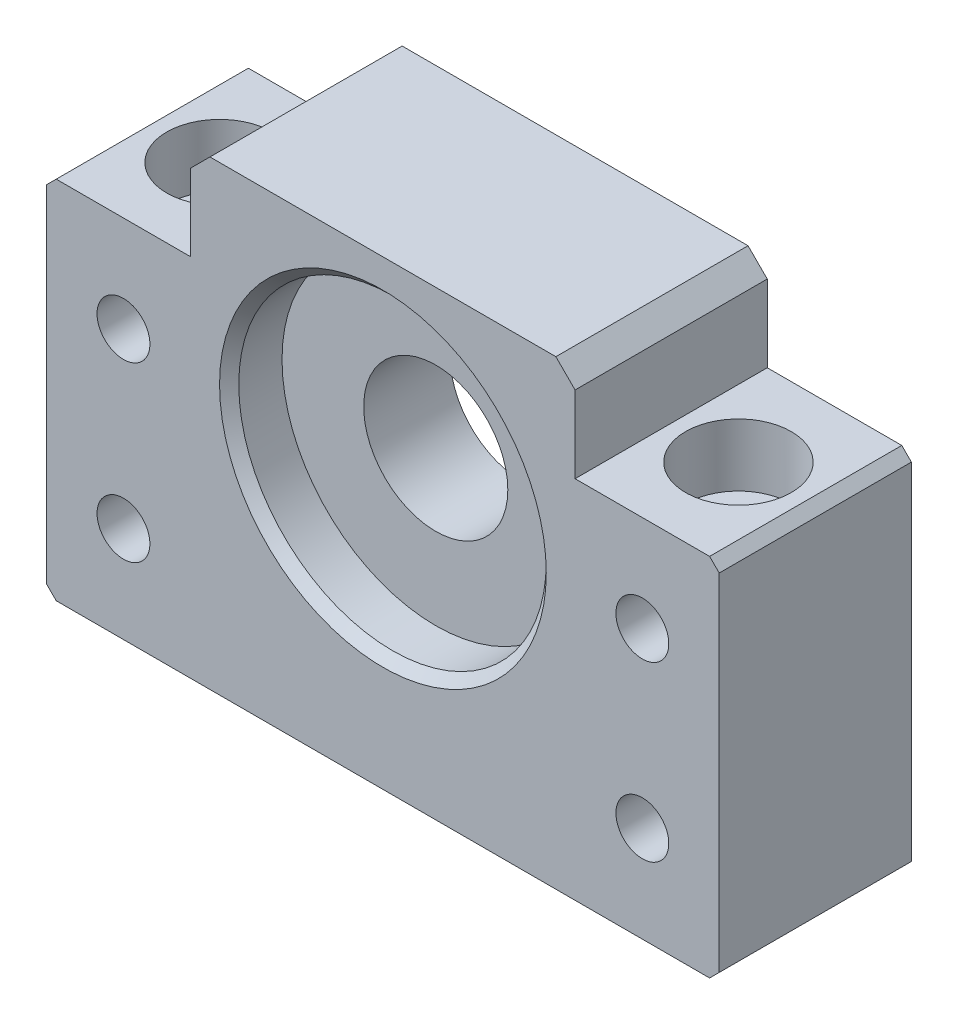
ISO-10303-21;
HEADER;
FILE_DESCRIPTION(('STEP AP214'),'2;1');
FILE_NAME('part.step','',(''),(''),'','','');
FILE_SCHEMA(('AUTOMOTIVE_DESIGN { 1 0 10303 214 1 1 1 1 }'));
ENDSEC;
DATA;
#1=APPLICATION_CONTEXT('core data for automotive mechanical design processes');
#2=APPLICATION_PROTOCOL_DEFINITION('international standard','automotive_design',2000,#1);
#3=PRODUCT_CONTEXT('',#1,'mechanical');
#4=PRODUCT('Part','Part','',(#3));
#5=PRODUCT_RELATED_PRODUCT_CATEGORY('part','',(#4));
#6=PRODUCT_DEFINITION_FORMATION('','',#4);
#7=PRODUCT_DEFINITION_CONTEXT('part definition',#1,'design');
#8=PRODUCT_DEFINITION('design','',#6,#7);
#9=PRODUCT_DEFINITION_SHAPE('','',#8);
#10=(LENGTH_UNIT() NAMED_UNIT(*) SI_UNIT(.MILLI.,.METRE.));
#11=(NAMED_UNIT(*) PLANE_ANGLE_UNIT() SI_UNIT($,.RADIAN.));
#12=(NAMED_UNIT(*) SI_UNIT($,.STERADIAN.) SOLID_ANGLE_UNIT());
#13=UNCERTAINTY_MEASURE_WITH_UNIT(LENGTH_MEASURE(1.E-05),#10,'distance_accuracy_value','');
#14=(GEOMETRIC_REPRESENTATION_CONTEXT(3) GLOBAL_UNCERTAINTY_ASSIGNED_CONTEXT((#13)) GLOBAL_UNIT_ASSIGNED_CONTEXT((#10,
#11,#12)) REPRESENTATION_CONTEXT('',''));
#15=CARTESIAN_POINT('',(0.,0.,0.));
#16=DIRECTION('',(0.,0.,1.));
#17=DIRECTION('',(1.,0.,0.));
#18=AXIS2_PLACEMENT_3D('',#15,#16,#17);
#19=CARTESIAN_POINT('',(0.,28.,-1.));
#20=DIRECTION('',(0.,0.,-1.));
#21=DIRECTION('',(-1.,0.,0.));
#22=AXIS2_PLACEMENT_3D('',#19,#20,#21);
#23=CYLINDRICAL_SURFACE('',#22,16.);
#24=CARTESIAN_POINT('',(0.,28.,14.5));
#25=DIRECTION('',(0.,0.,1.));
#26=DIRECTION('',(1.,0.,0.));
#27=AXIS2_PLACEMENT_3D('',#24,#25,#26);
#28=CIRCLE('',#27,16.);
#29=CARTESIAN_POINT('',(16.,28.,14.5));
#30=VERTEX_POINT('',#29);
#31=EDGE_CURVE('E11',#30,#30,#28,.T.);
#32=ORIENTED_EDGE('',*,*,#31,.F.);
#33=EDGE_LOOP('',(#32));
#34=FACE_BOUND('',#33,.T.);
#35=CARTESIAN_POINT('',(0.,28.,19.));
#36=DIRECTION('',(0.,0.,-1.));
#37=DIRECTION('',(-1.,0.,0.));
#38=AXIS2_PLACEMENT_3D('',#35,#36,#37);
#39=CIRCLE('',#38,16.);
#40=CARTESIAN_POINT('',(-16.,28.,19.));
#41=VERTEX_POINT('',#40);
#42=EDGE_CURVE('E163',#41,#41,#39,.T.);
#43=ORIENTED_EDGE('',*,*,#42,.F.);
#44=EDGE_LOOP('',(#43));
#45=FACE_BOUND('',#44,.T.);
#46=ADVANCED_FACE('F16',(#34,#45),#23,.F.);
#47=CARTESIAN_POINT('',(-50.,16.,19.9999999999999));
#48=DIRECTION('',(0.,0.,-1.));
#49=DIRECTION('',(-1.,0.,0.));
#50=AXIS2_PLACEMENT_3D('',#47,#48,#49);
#51=PLANE('',#50);
#52=CARTESIAN_POINT('',(27.,10.,19.9999999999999));
#53=DIRECTION('',(0.,0.,-1.));
#54=DIRECTION('',(-1.,0.,0.));
#55=AXIS2_PLACEMENT_3D('',#52,#53,#54);
#56=CIRCLE('',#55,2.75);
#57=CARTESIAN_POINT('',(24.25,10.,19.9999999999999));
#58=VERTEX_POINT('',#57);
#59=EDGE_CURVE('E735',#58,#58,#56,.T.);
#60=ORIENTED_EDGE('',*,*,#59,.T.);
#61=EDGE_LOOP('',(#60));
#62=FACE_BOUND('',#61,.T.);
#63=CARTESIAN_POINT('',(27.,28.,19.9999999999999));
#64=DIRECTION('',(0.,0.,-1.));
#65=DIRECTION('',(-1.,0.,0.));
#66=AXIS2_PLACEMENT_3D('',#63,#64,#65);
#67=CIRCLE('',#66,2.75);
#68=CARTESIAN_POINT('',(24.25,28.,19.9999999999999));
#69=VERTEX_POINT('',#68);
#70=EDGE_CURVE('E740',#69,#69,#67,.T.);
#71=ORIENTED_EDGE('',*,*,#70,.T.);
#72=EDGE_LOOP('',(#71));
#73=FACE_BOUND('',#72,.T.);
#74=CARTESIAN_POINT('',(-27.,10.,20.));
#75=DIRECTION('',(0.,0.,-1.));
#76=DIRECTION('',(-1.,0.,0.));
#77=AXIS2_PLACEMENT_3D('',#74,#75,#76);
#78=CIRCLE('',#77,2.75);
#79=CARTESIAN_POINT('',(-29.75,10.,20.));
#80=VERTEX_POINT('',#79);
#81=EDGE_CURVE('E284',#80,#80,#78,.T.);
#82=ORIENTED_EDGE('',*,*,#81,.T.);
#83=EDGE_LOOP('',(#82));
#84=FACE_BOUND('',#83,.T.);
#85=CARTESIAN_POINT('',(-27.,28.,20.));
#86=DIRECTION('',(0.,0.,-1.));
#87=DIRECTION('',(-1.,0.,0.));
#88=AXIS2_PLACEMENT_3D('',#85,#86,#87);
#89=CIRCLE('',#88,2.75);
#90=CARTESIAN_POINT('',(-29.75,28.,20.));
#91=VERTEX_POINT('',#90);
#92=EDGE_CURVE('E537',#91,#91,#89,.T.);
#93=ORIENTED_EDGE('',*,*,#92,.T.);
#94=EDGE_LOOP('',(#93));
#95=FACE_BOUND('',#94,.T.);
#96=DIRECTION('',(-0.707106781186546,0.707106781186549,0.));
#97=VECTOR('',#96,1.);
#98=CARTESIAN_POINT('',(-34.,0.,20.));
#99=LINE('',#98,#97);
#100=CARTESIAN_POINT('',(-34.,0.,20.));
#101=VERTEX_POINT('',#100);
#102=CARTESIAN_POINT('',(-35.,1.00000000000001,20.));
#103=VERTEX_POINT('',#102);
#104=EDGE_CURVE('E149',#101,#103,#99,.T.);
#105=ORIENTED_EDGE('',*,*,#104,.F.);
#106=DIRECTION('',(1.,0.,0.));
#107=VECTOR('',#106,1.);
#108=CARTESIAN_POINT('',(-34.,0.,20.));
#109=LINE('',#108,#107);
#110=CARTESIAN_POINT('',(34.,0.,19.9999999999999));
#111=VERTEX_POINT('',#110);
#112=EDGE_CURVE('E131',#101,#111,#109,.T.);
#113=ORIENTED_EDGE('',*,*,#112,.T.);
#114=DIRECTION('',(0.707106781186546,0.707106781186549,0.));
#115=VECTOR('',#114,1.);
#116=CARTESIAN_POINT('',(34.,0.,19.9999999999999));
#117=LINE('',#116,#115);
#118=CARTESIAN_POINT('',(35.,1.00000000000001,19.9999999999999));
#119=VERTEX_POINT('',#118);
#120=EDGE_CURVE('E169',#111,#119,#117,.T.);
#121=ORIENTED_EDGE('',*,*,#120,.T.);
#122=DIRECTION('',(0.,1.,0.));
#123=VECTOR('',#122,1.);
#124=CARTESIAN_POINT('',(35.,1.00000000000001,19.9999999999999));
#125=LINE('',#124,#123);
#126=CARTESIAN_POINT('',(35.,37.,19.9999999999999));
#127=VERTEX_POINT('',#126);
#128=EDGE_CURVE('E172',#119,#127,#125,.T.);
#129=ORIENTED_EDGE('',*,*,#128,.T.);
#130=DIRECTION('',(-0.707106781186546,0.707106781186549,0.));
#131=VECTOR('',#130,1.);
#132=CARTESIAN_POINT('',(35.,37.,19.9999999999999));
#133=LINE('',#132,#131);
#134=CARTESIAN_POINT('',(34.,38.,19.9999999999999));
#135=VERTEX_POINT('',#134);
#136=EDGE_CURVE('E175',#127,#135,#133,.T.);
#137=ORIENTED_EDGE('',*,*,#136,.T.);
#138=DIRECTION('',(-1.,0.,0.));
#139=VECTOR('',#138,1.);
#140=CARTESIAN_POINT('',(34.,38.,19.9999999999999));
#141=LINE('',#140,#139);
#142=CARTESIAN_POINT('',(20.,38.,19.9999999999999));
#143=VERTEX_POINT('',#142);
#144=EDGE_CURVE('E178',#135,#143,#141,.T.);
#145=ORIENTED_EDGE('',*,*,#144,.T.);
#146=DIRECTION('',(0.,1.,0.));
#147=VECTOR('',#146,1.);
#148=CARTESIAN_POINT('',(20.,38.,19.9999999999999));
#149=LINE('',#148,#147);
#150=CARTESIAN_POINT('',(20.,46.,19.9999999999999));
#151=VERTEX_POINT('',#150);
#152=EDGE_CURVE('E181',#143,#151,#149,.T.);
#153=ORIENTED_EDGE('',*,*,#152,.T.);
#154=DIRECTION('',(-0.707106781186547,0.707106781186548,0.));
#155=VECTOR('',#154,1.);
#156=CARTESIAN_POINT('',(20.,46.,19.9999999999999));
#157=LINE('',#156,#155);
#158=CARTESIAN_POINT('',(18.,48.,20.));
#159=VERTEX_POINT('',#158);
#160=EDGE_CURVE('E184',#151,#159,#157,.T.);
#161=ORIENTED_EDGE('',*,*,#160,.T.);
#162=DIRECTION('',(1.,0.,0.));
#163=VECTOR('',#162,1.);
#164=CARTESIAN_POINT('',(-18.,48.,19.9999999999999));
#165=LINE('',#164,#163);
#166=CARTESIAN_POINT('',(-18.,48.,19.9999999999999));
#167=VERTEX_POINT('',#166);
#168=EDGE_CURVE('E187',#167,#159,#165,.T.);
#169=ORIENTED_EDGE('',*,*,#168,.F.);
#170=DIRECTION('',(0.707106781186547,0.707106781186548,0.));
#171=VECTOR('',#170,1.);
#172=CARTESIAN_POINT('',(-20.,46.,20.));
#173=LINE('',#172,#171);
#174=CARTESIAN_POINT('',(-20.,46.,20.));
#175=VERTEX_POINT('',#174);
#176=EDGE_CURVE('E191',#175,#167,#173,.T.);
#177=ORIENTED_EDGE('',*,*,#176,.F.);
#178=DIRECTION('',(0.,1.,0.));
#179=VECTOR('',#178,1.);
#180=CARTESIAN_POINT('',(-20.,38.,20.));
#181=LINE('',#180,#179);
#182=CARTESIAN_POINT('',(-20.,38.,20.));
#183=VERTEX_POINT('',#182);
#184=EDGE_CURVE('E195',#183,#175,#181,.T.);
#185=ORIENTED_EDGE('',*,*,#184,.F.);
#186=DIRECTION('',(1.,0.,0.));
#187=VECTOR('',#186,1.);
#188=CARTESIAN_POINT('',(-34.0000000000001,38.,20.));
#189=LINE('',#188,#187);
#190=CARTESIAN_POINT('',(-34.0000000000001,38.,20.));
#191=VERTEX_POINT('',#190);
#192=EDGE_CURVE('E199',#191,#183,#189,.T.);
#193=ORIENTED_EDGE('',*,*,#192,.F.);
#194=DIRECTION('',(0.707106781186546,0.707106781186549,0.));
#195=VECTOR('',#194,1.);
#196=CARTESIAN_POINT('',(-35.0000000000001,37.,20.));
#197=LINE('',#196,#195);
#198=CARTESIAN_POINT('',(-35.0000000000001,37.,20.));
#199=VERTEX_POINT('',#198);
#200=EDGE_CURVE('E203',#199,#191,#197,.T.);
#201=ORIENTED_EDGE('',*,*,#200,.F.);
#202=DIRECTION('',(0.,1.,0.));
#203=VECTOR('',#202,1.);
#204=CARTESIAN_POINT('',(-35.,1.00000000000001,20.));
#205=LINE('',#204,#203);
#206=EDGE_CURVE('E206',#103,#199,#205,.T.);
#207=ORIENTED_EDGE('',*,*,#206,.F.);
#208=EDGE_LOOP('',(#105,#113,#121,#129,#137,#145,#153,#161,#169,#177,#185,#193,#201,#207));
#209=FACE_BOUND('',#208,.T.);
#210=CARTESIAN_POINT('',(0.,28.,20.));
#211=DIRECTION('',(0.,0.,-1.));
#212=DIRECTION('',(-1.,0.,0.));
#213=AXIS2_PLACEMENT_3D('',#210,#211,#212);
#214=CIRCLE('',#213,17.);
#215=CARTESIAN_POINT('',(-17.,28.,20.));
#216=VERTEX_POINT('',#215);
#217=EDGE_CURVE('E153',#216,#216,#214,.T.);
#218=ORIENTED_EDGE('',*,*,#217,.T.);
#219=EDGE_LOOP('',(#218));
#220=FACE_BOUND('',#219,.T.);
#221=ADVANCED_FACE('F357',(#62,#73,#84,#95,#209,#220),#51,.F.);
#222=CARTESIAN_POINT('',(-50.,16.,-1.11022302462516E-13));
#223=DIRECTION('',(0.,0.,-1.));
#224=DIRECTION('',(-1.,0.,0.));
#225=AXIS2_PLACEMENT_3D('',#222,#223,#224);
#226=PLANE('',#225);
#227=CARTESIAN_POINT('',(27.,10.,-1.11022302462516E-13));
#228=DIRECTION('',(0.,0.,-1.));
#229=DIRECTION('',(-1.,0.,0.));
#230=AXIS2_PLACEMENT_3D('',#227,#228,#229);
#231=CIRCLE('',#230,2.75);
#232=CARTESIAN_POINT('',(24.25,10.,-1.11022302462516E-13));
#233=VERTEX_POINT('',#232);
#234=EDGE_CURVE('E524',#233,#233,#231,.T.);
#235=ORIENTED_EDGE('',*,*,#234,.F.);
#236=EDGE_LOOP('',(#235));
#237=FACE_BOUND('',#236,.T.);
#238=CARTESIAN_POINT('',(27.,28.,-1.11022302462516E-13));
#239=DIRECTION('',(0.,0.,-1.));
#240=DIRECTION('',(-1.,0.,0.));
#241=AXIS2_PLACEMENT_3D('',#238,#239,#240);
#242=CIRCLE('',#241,2.75);
#243=CARTESIAN_POINT('',(24.25,28.,-1.11022302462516E-13));
#244=VERTEX_POINT('',#243);
#245=EDGE_CURVE('E528',#244,#244,#242,.T.);
#246=ORIENTED_EDGE('',*,*,#245,.F.);
#247=EDGE_LOOP('',(#246));
#248=FACE_BOUND('',#247,.T.);
#249=CARTESIAN_POINT('',(-27.,10.,0.));
#250=DIRECTION('',(0.,0.,-1.));
#251=DIRECTION('',(-1.,0.,0.));
#252=AXIS2_PLACEMENT_3D('',#249,#250,#251);
#253=CIRCLE('',#252,2.75);
#254=CARTESIAN_POINT('',(-29.75,10.,0.));
#255=VERTEX_POINT('',#254);
#256=EDGE_CURVE('E532',#255,#255,#253,.T.);
#257=ORIENTED_EDGE('',*,*,#256,.F.);
#258=EDGE_LOOP('',(#257));
#259=FACE_BOUND('',#258,.T.);
#260=CARTESIAN_POINT('',(-27.,28.,0.));
#261=DIRECTION('',(0.,0.,-1.));
#262=DIRECTION('',(-1.,0.,0.));
#263=AXIS2_PLACEMENT_3D('',#260,#261,#262);
#264=CIRCLE('',#263,2.75);
#265=CARTESIAN_POINT('',(-29.75,28.,0.));
#266=VERTEX_POINT('',#265);
#267=EDGE_CURVE('E535',#266,#266,#264,.T.);
#268=ORIENTED_EDGE('',*,*,#267,.F.);
#269=EDGE_LOOP('',(#268));
#270=FACE_BOUND('',#269,.T.);
#271=DIRECTION('',(-0.707106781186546,0.707106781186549,0.));
#272=VECTOR('',#271,1.);
#273=CARTESIAN_POINT('',(-34.,0.,0.));
#274=LINE('',#273,#272);
#275=CARTESIAN_POINT('',(-34.,0.,0.));
#276=VERTEX_POINT('',#275);
#277=CARTESIAN_POINT('',(-35.,1.,0.));
#278=VERTEX_POINT('',#277);
#279=EDGE_CURVE('E145',#276,#278,#274,.T.);
#280=ORIENTED_EDGE('',*,*,#279,.T.);
#281=DIRECTION('',(0.,1.,0.));
#282=VECTOR('',#281,1.);
#283=CARTESIAN_POINT('',(-35.,1.,0.));
#284=LINE('',#283,#282);
#285=CARTESIAN_POINT('',(-35.,37.,0.));
#286=VERTEX_POINT('',#285);
#287=EDGE_CURVE('E152',#278,#286,#284,.T.);
#288=ORIENTED_EDGE('',*,*,#287,.T.);
#289=DIRECTION('',(0.707106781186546,0.707106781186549,0.));
#290=VECTOR('',#289,1.);
#291=CARTESIAN_POINT('',(-35.,37.,0.));
#292=LINE('',#291,#290);
#293=CARTESIAN_POINT('',(-34.,38.,0.));
#294=VERTEX_POINT('',#293);
#295=EDGE_CURVE('E159',#286,#294,#292,.T.);
#296=ORIENTED_EDGE('',*,*,#295,.T.);
#297=DIRECTION('',(1.,0.,0.));
#298=VECTOR('',#297,1.);
#299=CARTESIAN_POINT('',(-34.,38.,0.));
#300=LINE('',#299,#298);
#301=CARTESIAN_POINT('',(-20.,38.,-1.11022302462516E-13));
#302=VERTEX_POINT('',#301);
#303=EDGE_CURVE('E432',#294,#302,#300,.T.);
#304=ORIENTED_EDGE('',*,*,#303,.T.);
#305=DIRECTION('',(0.,1.,0.));
#306=VECTOR('',#305,1.);
#307=CARTESIAN_POINT('',(-20.,38.,-1.11022302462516E-13));
#308=LINE('',#307,#306);
#309=CARTESIAN_POINT('',(-20.,46.,-1.11022302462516E-13));
#310=VERTEX_POINT('',#309);
#311=EDGE_CURVE('E428',#302,#310,#308,.T.);
#312=ORIENTED_EDGE('',*,*,#311,.T.);
#313=DIRECTION('',(0.707106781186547,0.707106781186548,0.));
#314=VECTOR('',#313,1.);
#315=CARTESIAN_POINT('',(-20.,46.,-1.11022302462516E-13));
#316=LINE('',#315,#314);
#317=CARTESIAN_POINT('',(-18.,48.,-1.11022302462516E-13));
#318=VERTEX_POINT('',#317);
#319=EDGE_CURVE('E424',#310,#318,#316,.T.);
#320=ORIENTED_EDGE('',*,*,#319,.T.);
#321=DIRECTION('',(1.,0.,0.));
#322=VECTOR('',#321,1.);
#323=CARTESIAN_POINT('',(-18.,48.,-1.11022302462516E-13));
#324=LINE('',#323,#322);
#325=CARTESIAN_POINT('',(18.,48.,-1.11022302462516E-13));
#326=VERTEX_POINT('',#325);
#327=EDGE_CURVE('E420',#318,#326,#324,.T.);
#328=ORIENTED_EDGE('',*,*,#327,.T.);
#329=DIRECTION('',(-0.707106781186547,0.707106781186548,0.));
#330=VECTOR('',#329,1.);
#331=CARTESIAN_POINT('',(20.,46.,-1.11022302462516E-13));
#332=LINE('',#331,#330);
#333=CARTESIAN_POINT('',(20.,46.,-1.11022302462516E-13));
#334=VERTEX_POINT('',#333);
#335=EDGE_CURVE('E416',#334,#326,#332,.T.);
#336=ORIENTED_EDGE('',*,*,#335,.F.);
#337=DIRECTION('',(0.,1.,0.));
#338=VECTOR('',#337,1.);
#339=CARTESIAN_POINT('',(20.,38.,-1.11022302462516E-13));
#340=LINE('',#339,#338);
#341=CARTESIAN_POINT('',(20.,38.,-1.11022302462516E-13));
#342=VERTEX_POINT('',#341);
#343=EDGE_CURVE('E413',#342,#334,#340,.T.);
#344=ORIENTED_EDGE('',*,*,#343,.F.);
#345=DIRECTION('',(-1.,0.,0.));
#346=VECTOR('',#345,1.);
#347=CARTESIAN_POINT('',(34.,38.,-1.11022302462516E-13));
#348=LINE('',#347,#346);
#349=CARTESIAN_POINT('',(34.,38.,-1.11022302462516E-13));
#350=VERTEX_POINT('',#349);
#351=EDGE_CURVE('E410',#350,#342,#348,.T.);
#352=ORIENTED_EDGE('',*,*,#351,.F.);
#353=DIRECTION('',(-0.707106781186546,0.707106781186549,0.));
#354=VECTOR('',#353,1.);
#355=CARTESIAN_POINT('',(35.,37.,-1.11022302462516E-13));
#356=LINE('',#355,#354);
#357=CARTESIAN_POINT('',(35.,37.,-1.11022302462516E-13));
#358=VERTEX_POINT('',#357);
#359=EDGE_CURVE('E407',#358,#350,#356,.T.);
#360=ORIENTED_EDGE('',*,*,#359,.F.);
#361=DIRECTION('',(0.,1.,0.));
#362=VECTOR('',#361,1.);
#363=CARTESIAN_POINT('',(35.,1.,-1.11022302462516E-13));
#364=LINE('',#363,#362);
#365=CARTESIAN_POINT('',(35.,1.,-1.11022302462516E-13));
#366=VERTEX_POINT('',#365);
#367=EDGE_CURVE('E404',#366,#358,#364,.T.);
#368=ORIENTED_EDGE('',*,*,#367,.F.);
#369=DIRECTION('',(0.707106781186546,0.707106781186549,0.));
#370=VECTOR('',#369,1.);
#371=CARTESIAN_POINT('',(34.,0.,-1.11022302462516E-13));
#372=LINE('',#371,#370);
#373=CARTESIAN_POINT('',(34.,0.,-1.11022302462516E-13));
#374=VERTEX_POINT('',#373);
#375=EDGE_CURVE('E147',#374,#366,#372,.T.);
#376=ORIENTED_EDGE('',*,*,#375,.F.);
#377=DIRECTION('',(1.,0.,0.));
#378=VECTOR('',#377,1.);
#379=CARTESIAN_POINT('',(-34.,0.,0.));
#380=LINE('',#379,#378);
#381=EDGE_CURVE('E129',#276,#374,#380,.T.);
#382=ORIENTED_EDGE('',*,*,#381,.F.);
#383=EDGE_LOOP('',(#280,#288,#296,#304,#312,#320,#328,#336,#344,#352,#360,#368,#376,#382));
#384=FACE_BOUND('',#383,.T.);
#385=CARTESIAN_POINT('',(0.,28.,0.));
#386=DIRECTION('',(0.,0.,-1.));
#387=DIRECTION('',(-1.,0.,0.));
#388=AXIS2_PLACEMENT_3D('',#385,#386,#387);
#389=CIRCLE('',#388,17.);
#390=CARTESIAN_POINT('',(-17.,28.,0.));
#391=VERTEX_POINT('',#390);
#392=EDGE_CURVE('E389',#391,#391,#389,.T.);
#393=ORIENTED_EDGE('',*,*,#392,.F.);
#394=EDGE_LOOP('',(#393));
#395=FACE_BOUND('',#394,.T.);
#396=ADVANCED_FACE('F142',(#237,#248,#259,#270,#384,#395),#226,.T.);
#397=CARTESIAN_POINT('',(-34.,0.,20.));
#398=DIRECTION('',(-0.707106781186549,-0.707106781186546,0.));
#399=DIRECTION('',(0.707106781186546,-0.707106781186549,0.));
#400=AXIS2_PLACEMENT_3D('',#397,#398,#399);
#401=PLANE('',#400);
#402=ORIENTED_EDGE('',*,*,#279,.F.);
#403=DIRECTION('',(0.,0.,-1.));
#404=VECTOR('',#403,1.);
#405=CARTESIAN_POINT('',(-34.,0.,20.));
#406=LINE('',#405,#404);
#407=EDGE_CURVE('E125',#101,#276,#406,.T.);
#408=ORIENTED_EDGE('',*,*,#407,.F.);
#409=ORIENTED_EDGE('',*,*,#104,.T.);
#410=DIRECTION('',(0.,0.,-1.));
#411=VECTOR('',#410,1.);
#412=CARTESIAN_POINT('',(-35.,1.00000000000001,20.));
#413=LINE('',#412,#411);
#414=EDGE_CURVE('E38',#103,#278,#413,.T.);
#415=ORIENTED_EDGE('',*,*,#414,.T.);
#416=EDGE_LOOP('',(#402,#408,#409,#415));
#417=FACE_BOUND('',#416,.T.);
#418=ADVANCED_FACE('F18',(#417),#401,.T.);
#419=CARTESIAN_POINT('',(-34.,0.,20.));
#420=DIRECTION('',(0.,1.,0.));
#421=DIRECTION('',(0.,0.,1.));
#422=AXIS2_PLACEMENT_3D('',#419,#420,#421);
#423=PLANE('',#422);
#424=CARTESIAN_POINT('',(27.,0.,9.9999999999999));
#425=DIRECTION('',(0.,1.,0.));
#426=DIRECTION('',(0.,0.,1.));
#427=AXIS2_PLACEMENT_3D('',#424,#425,#426);
#428=CIRCLE('',#427,3.3);
#429=CARTESIAN_POINT('',(27.,0.,13.2999999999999));
#430=VERTEX_POINT('',#429);
#431=EDGE_CURVE('E269',#430,#430,#428,.T.);
#432=ORIENTED_EDGE('',*,*,#431,.T.);
#433=EDGE_LOOP('',(#432));
#434=FACE_BOUND('',#433,.T.);
#435=CARTESIAN_POINT('',(-27.,0.,10.));
#436=DIRECTION('',(0.,1.,0.));
#437=DIRECTION('',(0.,0.,1.));
#438=AXIS2_PLACEMENT_3D('',#435,#436,#437);
#439=CIRCLE('',#438,3.3);
#440=CARTESIAN_POINT('',(-27.,0.,13.3));
#441=VERTEX_POINT('',#440);
#442=EDGE_CURVE('E259',#441,#441,#439,.T.);
#443=ORIENTED_EDGE('',*,*,#442,.T.);
#444=EDGE_LOOP('',(#443));
#445=FACE_BOUND('',#444,.T.);
#446=ORIENTED_EDGE('',*,*,#381,.T.);
#447=DIRECTION('',(0.,0.,-1.));
#448=VECTOR('',#447,1.);
#449=CARTESIAN_POINT('',(34.,0.,19.9999999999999));
#450=LINE('',#449,#448);
#451=EDGE_CURVE('E137',#111,#374,#450,.T.);
#452=ORIENTED_EDGE('',*,*,#451,.F.);
#453=ORIENTED_EDGE('',*,*,#112,.F.);
#454=ORIENTED_EDGE('',*,*,#407,.T.);
#455=EDGE_LOOP('',(#446,#452,#453,#454));
#456=FACE_BOUND('',#455,.T.);
#457=ADVANCED_FACE('F127',(#434,#445,#456),#423,.F.);
#458=CARTESIAN_POINT('',(34.,0.,19.9999999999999));
#459=DIRECTION('',(-0.707106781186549,0.707106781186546,0.));
#460=DIRECTION('',(-0.707106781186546,-0.707106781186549,0.));
#461=AXIS2_PLACEMENT_3D('',#458,#459,#460);
#462=PLANE('',#461);
#463=ORIENTED_EDGE('',*,*,#375,.T.);
#464=DIRECTION('',(0.,0.,-1.));
#465=VECTOR('',#464,1.);
#466=CARTESIAN_POINT('',(35.,1.00000000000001,19.9999999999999));
#467=LINE('',#466,#465);
#468=EDGE_CURVE('E246',#119,#366,#467,.T.);
#469=ORIENTED_EDGE('',*,*,#468,.F.);
#470=ORIENTED_EDGE('',*,*,#120,.F.);
#471=ORIENTED_EDGE('',*,*,#451,.T.);
#472=EDGE_LOOP('',(#463,#469,#470,#471));
#473=FACE_BOUND('',#472,.T.);
#474=ADVANCED_FACE('F482',(#473),#462,.F.);
#475=CARTESIAN_POINT('',(35.,1.00000000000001,19.9999999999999));
#476=DIRECTION('',(-1.,0.,0.));
#477=DIRECTION('',(0.,0.,1.));
#478=AXIS2_PLACEMENT_3D('',#475,#476,#477);
#479=PLANE('',#478);
#480=ORIENTED_EDGE('',*,*,#367,.T.);
#481=DIRECTION('',(0.,0.,-1.));
#482=VECTOR('',#481,1.);
#483=CARTESIAN_POINT('',(35.,37.,19.9999999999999));
#484=LINE('',#483,#482);
#485=EDGE_CURVE('E242',#127,#358,#484,.T.);
#486=ORIENTED_EDGE('',*,*,#485,.F.);
#487=ORIENTED_EDGE('',*,*,#128,.F.);
#488=ORIENTED_EDGE('',*,*,#468,.T.);
#489=EDGE_LOOP('',(#480,#486,#487,#488));
#490=FACE_BOUND('',#489,.T.);
#491=ADVANCED_FACE('F477',(#490),#479,.F.);
#492=CARTESIAN_POINT('',(35.,37.,19.9999999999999));
#493=DIRECTION('',(-0.707106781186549,-0.707106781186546,0.));
#494=DIRECTION('',(0.707106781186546,-0.707106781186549,0.));
#495=AXIS2_PLACEMENT_3D('',#492,#493,#494);
#496=PLANE('',#495);
#497=ORIENTED_EDGE('',*,*,#359,.T.);
#498=DIRECTION('',(0.,0.,-1.));
#499=VECTOR('',#498,1.);
#500=CARTESIAN_POINT('',(34.,38.,19.9999999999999));
#501=LINE('',#500,#499);
#502=EDGE_CURVE('E238',#135,#350,#501,.T.);
#503=ORIENTED_EDGE('',*,*,#502,.F.);
#504=ORIENTED_EDGE('',*,*,#136,.F.);
#505=ORIENTED_EDGE('',*,*,#485,.T.);
#506=EDGE_LOOP('',(#497,#503,#504,#505));
#507=FACE_BOUND('',#506,.T.);
#508=ADVANCED_FACE('F474',(#507),#496,.F.);
#509=CARTESIAN_POINT('',(34.,38.,19.9999999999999));
#510=DIRECTION('',(0.,-1.,0.));
#511=DIRECTION('',(0.,0.,-1.));
#512=AXIS2_PLACEMENT_3D('',#509,#510,#511);
#513=PLANE('',#512);
#514=CARTESIAN_POINT('',(27.,38.,9.9999999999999));
#515=DIRECTION('',(0.,-1.,0.));
#516=DIRECTION('',(0.,0.,-1.));
#517=AXIS2_PLACEMENT_3D('',#514,#515,#516);
#518=CIRCLE('',#517,5.5);
#519=CARTESIAN_POINT('',(27.,38.,4.49999999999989));
#520=VERTEX_POINT('',#519);
#521=EDGE_CURVE('E265',#520,#520,#518,.T.);
#522=ORIENTED_EDGE('',*,*,#521,.T.);
#523=EDGE_LOOP('',(#522));
#524=FACE_BOUND('',#523,.T.);
#525=ORIENTED_EDGE('',*,*,#351,.T.);
#526=DIRECTION('',(0.,0.,-1.));
#527=VECTOR('',#526,1.);
#528=CARTESIAN_POINT('',(20.,38.,19.9999999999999));
#529=LINE('',#528,#527);
#530=EDGE_CURVE('E234',#143,#342,#529,.T.);
#531=ORIENTED_EDGE('',*,*,#530,.F.);
#532=ORIENTED_EDGE('',*,*,#144,.F.);
#533=ORIENTED_EDGE('',*,*,#502,.T.);
#534=EDGE_LOOP('',(#525,#531,#532,#533));
#535=FACE_BOUND('',#534,.T.);
#536=ADVANCED_FACE('F470',(#524,#535),#513,.F.);
#537=CARTESIAN_POINT('',(20.,38.,19.9999999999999));
#538=DIRECTION('',(-1.,0.,0.));
#539=DIRECTION('',(0.,-1.,0.));
#540=AXIS2_PLACEMENT_3D('',#537,#538,#539);
#541=PLANE('',#540);
#542=ORIENTED_EDGE('',*,*,#343,.T.);
#543=DIRECTION('',(0.,0.,-1.));
#544=VECTOR('',#543,1.);
#545=CARTESIAN_POINT('',(20.,46.,19.9999999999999));
#546=LINE('',#545,#544);
#547=EDGE_CURVE('E230',#151,#334,#546,.T.);
#548=ORIENTED_EDGE('',*,*,#547,.F.);
#549=ORIENTED_EDGE('',*,*,#152,.F.);
#550=ORIENTED_EDGE('',*,*,#530,.T.);
#551=EDGE_LOOP('',(#542,#548,#549,#550));
#552=FACE_BOUND('',#551,.T.);
#553=ADVANCED_FACE('F465',(#552),#541,.F.);
#554=CARTESIAN_POINT('',(20.,46.,19.9999999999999));
#555=DIRECTION('',(-0.707106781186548,-0.707106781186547,0.));
#556=DIRECTION('',(0.707106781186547,-0.707106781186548,0.));
#557=AXIS2_PLACEMENT_3D('',#554,#555,#556);
#558=PLANE('',#557);
#559=ORIENTED_EDGE('',*,*,#335,.T.);
#560=DIRECTION('',(0.,0.,-1.));
#561=VECTOR('',#560,1.);
#562=CARTESIAN_POINT('',(18.,48.,20.));
#563=LINE('',#562,#561);
#564=EDGE_CURVE('E227',#159,#326,#563,.T.);
#565=ORIENTED_EDGE('',*,*,#564,.F.);
#566=ORIENTED_EDGE('',*,*,#160,.F.);
#567=ORIENTED_EDGE('',*,*,#547,.T.);
#568=EDGE_LOOP('',(#559,#565,#566,#567));
#569=FACE_BOUND('',#568,.T.);
#570=ADVANCED_FACE('F459',(#569),#558,.F.);
#571=CARTESIAN_POINT('',(-18.,48.,19.9999999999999));
#572=DIRECTION('',(0.,1.,0.));
#573=DIRECTION('',(0.,0.,1.));
#574=AXIS2_PLACEMENT_3D('',#571,#572,#573);
#575=PLANE('',#574);
#576=ORIENTED_EDGE('',*,*,#327,.F.);
#577=DIRECTION('',(0.,0.,-1.));
#578=VECTOR('',#577,1.);
#579=CARTESIAN_POINT('',(-18.,48.,19.9999999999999));
#580=LINE('',#579,#578);
#581=EDGE_CURVE('E224',#167,#318,#580,.T.);
#582=ORIENTED_EDGE('',*,*,#581,.F.);
#583=ORIENTED_EDGE('',*,*,#168,.T.);
#584=ORIENTED_EDGE('',*,*,#564,.T.);
#585=EDGE_LOOP('',(#576,#582,#583,#584));
#586=FACE_BOUND('',#585,.T.);
#587=ADVANCED_FACE('F455',(#586),#575,.T.);
#588=CARTESIAN_POINT('',(-20.,46.,20.));
#589=DIRECTION('',(-0.707106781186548,0.707106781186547,0.));
#590=DIRECTION('',(-0.707106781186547,-0.707106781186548,0.));
#591=AXIS2_PLACEMENT_3D('',#588,#589,#590);
#592=PLANE('',#591);
#593=ORIENTED_EDGE('',*,*,#319,.F.);
#594=DIRECTION('',(0.,0.,-1.));
#595=VECTOR('',#594,1.);
#596=CARTESIAN_POINT('',(-20.,46.,20.));
#597=LINE('',#596,#595);
#598=EDGE_CURVE('E221',#175,#310,#597,.T.);
#599=ORIENTED_EDGE('',*,*,#598,.F.);
#600=ORIENTED_EDGE('',*,*,#176,.T.);
#601=ORIENTED_EDGE('',*,*,#581,.T.);
#602=EDGE_LOOP('',(#593,#599,#600,#601));
#603=FACE_BOUND('',#602,.T.);
#604=ADVANCED_FACE('F451',(#603),#592,.T.);
#605=CARTESIAN_POINT('',(-20.,38.,20.));
#606=DIRECTION('',(-1.,0.,0.));
#607=DIRECTION('',(0.,-1.,0.));
#608=AXIS2_PLACEMENT_3D('',#605,#606,#607);
#609=PLANE('',#608);
#610=ORIENTED_EDGE('',*,*,#311,.F.);
#611=DIRECTION('',(0.,0.,-1.));
#612=VECTOR('',#611,1.);
#613=CARTESIAN_POINT('',(-20.,38.,20.));
#614=LINE('',#613,#612);
#615=EDGE_CURVE('E218',#183,#302,#614,.T.);
#616=ORIENTED_EDGE('',*,*,#615,.F.);
#617=ORIENTED_EDGE('',*,*,#184,.T.);
#618=ORIENTED_EDGE('',*,*,#598,.T.);
#619=EDGE_LOOP('',(#610,#616,#617,#618));
#620=FACE_BOUND('',#619,.T.);
#621=ADVANCED_FACE('F446',(#620),#609,.T.);
#622=CARTESIAN_POINT('',(-34.0000000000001,38.,20.));
#623=DIRECTION('',(0.,1.,0.));
#624=DIRECTION('',(0.,0.,1.));
#625=AXIS2_PLACEMENT_3D('',#622,#623,#624);
#626=PLANE('',#625);
#627=CARTESIAN_POINT('',(-27.,38.,10.));
#628=DIRECTION('',(0.,1.,0.));
#629=DIRECTION('',(0.,0.,1.));
#630=AXIS2_PLACEMENT_3D('',#627,#628,#629);
#631=CIRCLE('',#630,5.5);
#632=CARTESIAN_POINT('',(-27.,38.,15.5));
#633=VERTEX_POINT('',#632);
#634=EDGE_CURVE('E255',#633,#633,#631,.T.);
#635=ORIENTED_EDGE('',*,*,#634,.F.);
#636=EDGE_LOOP('',(#635));
#637=FACE_BOUND('',#636,.T.);
#638=ORIENTED_EDGE('',*,*,#303,.F.);
#639=DIRECTION('',(0.,0.,-1.));
#640=VECTOR('',#639,1.);
#641=CARTESIAN_POINT('',(-34.0000000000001,38.,20.));
#642=LINE('',#641,#640);
#643=EDGE_CURVE('E215',#191,#294,#642,.T.);
#644=ORIENTED_EDGE('',*,*,#643,.F.);
#645=ORIENTED_EDGE('',*,*,#192,.T.);
#646=ORIENTED_EDGE('',*,*,#615,.T.);
#647=EDGE_LOOP('',(#638,#644,#645,#646));
#648=FACE_BOUND('',#647,.T.);
#649=ADVANCED_FACE('F442',(#637,#648),#626,.T.);
#650=CARTESIAN_POINT('',(-35.0000000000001,37.,20.));
#651=DIRECTION('',(-0.707106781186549,0.707106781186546,0.));
#652=DIRECTION('',(-0.707106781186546,-0.707106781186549,0.));
#653=AXIS2_PLACEMENT_3D('',#650,#651,#652);
#654=PLANE('',#653);
#655=ORIENTED_EDGE('',*,*,#295,.F.);
#656=DIRECTION('',(0.,0.,-1.));
#657=VECTOR('',#656,1.);
#658=CARTESIAN_POINT('',(-35.0000000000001,37.,20.));
#659=LINE('',#658,#657);
#660=EDGE_CURVE('E46',#199,#286,#659,.T.);
#661=ORIENTED_EDGE('',*,*,#660,.F.);
#662=ORIENTED_EDGE('',*,*,#200,.T.);
#663=ORIENTED_EDGE('',*,*,#643,.T.);
#664=EDGE_LOOP('',(#655,#661,#662,#663));
#665=FACE_BOUND('',#664,.T.);
#666=ADVANCED_FACE('F439',(#665),#654,.T.);
#667=CARTESIAN_POINT('',(-35.,1.00000000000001,20.));
#668=DIRECTION('',(-1.,0.,0.));
#669=DIRECTION('',(0.,0.,1.));
#670=AXIS2_PLACEMENT_3D('',#667,#668,#669);
#671=PLANE('',#670);
#672=ORIENTED_EDGE('',*,*,#287,.F.);
#673=ORIENTED_EDGE('',*,*,#414,.F.);
#674=ORIENTED_EDGE('',*,*,#206,.T.);
#675=ORIENTED_EDGE('',*,*,#660,.T.);
#676=EDGE_LOOP('',(#672,#673,#674,#675));
#677=FACE_BOUND('',#676,.T.);
#678=ADVANCED_FACE('F380',(#677),#671,.T.);
#679=CARTESIAN_POINT('',(0.,28.,20.));
#680=DIRECTION('',(0.,0.,1.));
#681=DIRECTION('',(1.,0.,0.));
#682=AXIS2_PLACEMENT_3D('',#679,#680,#681);
#683=CONICAL_SURFACE('',#682,17.,0.785398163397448);
#684=ORIENTED_EDGE('',*,*,#42,.T.);
#685=EDGE_LOOP('',(#684));
#686=FACE_BOUND('',#685,.T.);
#687=ORIENTED_EDGE('',*,*,#217,.F.);
#688=EDGE_LOOP('',(#687));
#689=FACE_BOUND('',#688,.T.);
#690=ADVANCED_FACE('F372',(#686,#689),#683,.F.);
#691=CARTESIAN_POINT('',(0.,28.,5.50000000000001));
#692=DIRECTION('',(0.,0.,-1.));
#693=DIRECTION('',(-1.,0.,0.));
#694=AXIS2_PLACEMENT_3D('',#691,#692,#693);
#695=CIRCLE('',#694,16.);
#696=CARTESIAN_POINT('',(-16.,28.,5.50000000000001));
#697=VERTEX_POINT('',#696);
#698=EDGE_CURVE('E30',#697,#697,#695,.T.);
#699=ORIENTED_EDGE('',*,*,#698,.F.);
#700=EDGE_LOOP('',(#699));
#701=FACE_BOUND('',#700,.T.);
#702=CARTESIAN_POINT('',(0.,28.,1.));
#703=DIRECTION('',(0.,0.,-1.));
#704=DIRECTION('',(-1.,0.,0.));
#705=AXIS2_PLACEMENT_3D('',#702,#703,#704);
#706=CIRCLE('',#705,16.);
#707=CARTESIAN_POINT('',(-16.,28.,1.));
#708=VERTEX_POINT('',#707);
#709=EDGE_CURVE('E386',#708,#708,#706,.T.);
#710=ORIENTED_EDGE('',*,*,#709,.T.);
#711=EDGE_LOOP('',(#710));
#712=FACE_BOUND('',#711,.T.);
#713=ADVANCED_FACE('F360',(#701,#712),#23,.F.);
#714=CARTESIAN_POINT('',(0.,28.,1.));
#715=DIRECTION('',(0.,0.,-1.));
#716=DIRECTION('',(-1.,0.,0.));
#717=AXIS2_PLACEMENT_3D('',#714,#715,#716);
#718=CONICAL_SURFACE('',#717,16.,0.785398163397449);
#719=ORIENTED_EDGE('',*,*,#392,.T.);
#720=EDGE_LOOP('',(#719));
#721=FACE_BOUND('',#720,.T.);
#722=ORIENTED_EDGE('',*,*,#709,.F.);
#723=EDGE_LOOP('',(#722));
#724=FACE_BOUND('',#723,.T.);
#725=ADVANCED_FACE('F371',(#721,#724),#718,.F.);
#726=CARTESIAN_POINT('',(0.,28.,14.5));
#727=DIRECTION('',(0.,0.,1.));
#728=DIRECTION('',(1.,0.,0.));
#729=AXIS2_PLACEMENT_3D('',#726,#727,#728);
#730=PLANE('',#729);
#731=ORIENTED_EDGE('',*,*,#31,.T.);
#732=EDGE_LOOP('',(#731));
#733=FACE_BOUND('',#732,.T.);
#734=CARTESIAN_POINT('',(0.,28.,14.5));
#735=DIRECTION('',(0.,0.,1.));
#736=DIRECTION('',(1.,0.,0.));
#737=AXIS2_PLACEMENT_3D('',#734,#735,#736);
#738=CIRCLE('',#737,7.5);
#739=CARTESIAN_POINT('',(7.50000000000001,28.,14.5));
#740=VERTEX_POINT('',#739);
#741=EDGE_CURVE('E398',#740,#740,#738,.T.);
#742=ORIENTED_EDGE('',*,*,#741,.F.);
#743=EDGE_LOOP('',(#742));
#744=FACE_BOUND('',#743,.T.);
#745=ADVANCED_FACE('F378',(#733,#744),#730,.T.);
#746=CARTESIAN_POINT('',(0.,28.,5.50000000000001));
#747=DIRECTION('',(0.,0.,-1.));
#748=DIRECTION('',(-1.,0.,0.));
#749=AXIS2_PLACEMENT_3D('',#746,#747,#748);
#750=PLANE('',#749);
#751=ORIENTED_EDGE('',*,*,#698,.T.);
#752=EDGE_LOOP('',(#751));
#753=FACE_BOUND('',#752,.T.);
#754=CARTESIAN_POINT('',(0.,28.,5.50000000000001));
#755=DIRECTION('',(0.,0.,-1.));
#756=DIRECTION('',(-1.,0.,0.));
#757=AXIS2_PLACEMENT_3D('',#754,#755,#756);
#758=CIRCLE('',#757,7.5);
#759=CARTESIAN_POINT('',(-7.50000000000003,28.,5.50000000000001));
#760=VERTEX_POINT('',#759);
#761=EDGE_CURVE('E264',#760,#760,#758,.T.);
#762=ORIENTED_EDGE('',*,*,#761,.F.);
#763=EDGE_LOOP('',(#762));
#764=FACE_BOUND('',#763,.T.);
#765=ADVANCED_FACE('F573',(#753,#764),#750,.T.);
#766=CARTESIAN_POINT('',(0.,28.,0.));
#767=DIRECTION('',(0.,0.,1.));
#768=DIRECTION('',(0.,1.,0.));
#769=AXIS2_PLACEMENT_3D('',#766,#767,#768);
#770=CYLINDRICAL_SURFACE('',#769,7.5);
#771=ORIENTED_EDGE('',*,*,#741,.T.);
#772=EDGE_LOOP('',(#771));
#773=FACE_BOUND('',#772,.T.);
#774=ORIENTED_EDGE('',*,*,#761,.T.);
#775=EDGE_LOOP('',(#774));
#776=FACE_BOUND('',#775,.T.);
#777=ADVANCED_FACE('F571',(#773,#776),#770,.F.);
#778=CARTESIAN_POINT('',(-27.,-1.,10.));
#779=DIRECTION('',(0.,1.,0.));
#780=DIRECTION('',(1.,0.,0.));
#781=AXIS2_PLACEMENT_3D('',#778,#779,#780);
#782=CYLINDRICAL_SURFACE('',#781,3.3);
#783=CARTESIAN_POINT('',(-27.,12.75,6.69999999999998));
#784=CARTESIAN_POINT('',(-26.8693667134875,12.7499946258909,6.70000524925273));
#785=CARTESIAN_POINT('',(-26.7386935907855,12.740625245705,6.70782462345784));
#786=CARTESIAN_POINT('',(-26.481699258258,12.703841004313,6.73838160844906));
#787=CARTESIAN_POINT('',(-26.3553813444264,12.6764127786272,6.76113026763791));
#788=CARTESIAN_POINT('',(-26.111387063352,12.605556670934,6.8194304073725));
#789=CARTESIAN_POINT('',(-25.9936639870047,12.5622244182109,6.85490533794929));
#790=CARTESIAN_POINT('',(-25.7681744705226,12.4617812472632,6.93617906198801));
#791=CARTESIAN_POINT('',(-25.6604114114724,12.4046656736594,6.98198134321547));
#792=CARTESIAN_POINT('',(-25.4183100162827,12.2556008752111,7.09958389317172));
#793=CARTESIAN_POINT('',(-25.2887495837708,12.1585627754,7.1747539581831));
#794=CARTESIAN_POINT('',(-25.0507736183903,11.9464232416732,7.33335112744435));
#795=CARTESIAN_POINT('',(-24.9424187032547,11.8312716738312,7.41680090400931));
#796=CARTESIAN_POINT('',(-24.7951900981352,11.6455072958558,7.54375625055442));
#797=CARTESIAN_POINT('',(-24.7483030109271,11.5807488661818,7.58677952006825));
#798=CARTESIAN_POINT('',(-24.6601317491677,11.447043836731,7.6721732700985));
#799=CARTESIAN_POINT('',(-24.6188494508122,11.3780958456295,7.71454352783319));
#800=CARTESIAN_POINT('',(-24.5421476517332,11.2361059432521,7.79724402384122));
#801=CARTESIAN_POINT('',(-24.5067143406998,11.1630742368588,7.83757890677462));
#802=CARTESIAN_POINT('',(-24.4419094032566,11.0126090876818,7.9146454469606));
#803=CARTESIAN_POINT('',(-24.4125326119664,10.9351794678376,7.95138016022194));
#804=CARTESIAN_POINT('',(-24.3578713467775,10.7681662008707,8.02228889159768));
#805=CARTESIAN_POINT('',(-24.3332281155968,10.678123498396,8.05590057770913));
#806=CARTESIAN_POINT('',(-24.2928855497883,10.4929212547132,8.11247501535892));
#807=CARTESIAN_POINT('',(-24.2771645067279,10.3977747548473,8.13546358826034));
#808=CARTESIAN_POINT('',(-24.2557081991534,10.2026580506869,8.16716978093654));
#809=CARTESIAN_POINT('',(-24.2500967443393,10.1026432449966,8.17571038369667));
#810=CARTESIAN_POINT('',(-24.2499057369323,9.9025811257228,8.17599860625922));
#811=CARTESIAN_POINT('',(-24.2553263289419,9.80253381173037,8.1677460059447));
#812=CARTESIAN_POINT('',(-24.2774421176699,9.59792281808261,8.13504196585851));
#813=CARTESIAN_POINT('',(-24.2950386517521,9.49367687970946,8.10929874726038));
#814=CARTESIAN_POINT('',(-24.3408319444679,9.29136792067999,8.04542940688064));
#815=CARTESIAN_POINT('',(-24.369063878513,9.19332669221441,8.00726225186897));
#816=CARTESIAN_POINT('',(-24.4280210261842,9.02339021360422,7.93197551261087));
#817=CARTESIAN_POINT('',(-24.4570473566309,8.9502565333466,7.89624651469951));
#818=CARTESIAN_POINT('',(-24.5205513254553,8.80798411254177,7.82175803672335));
#819=CARTESIAN_POINT('',(-24.5550321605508,8.73884774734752,7.78299678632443));
#820=CARTESIAN_POINT('',(-24.6663535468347,8.53703647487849,7.66423087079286));
#821=CARTESIAN_POINT('',(-24.7510426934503,8.41004443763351,7.58178533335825));
#822=CARTESIAN_POINT('',(-24.9455749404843,8.16490634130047,7.41412112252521));
#823=CARTESIAN_POINT('',(-25.0565001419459,8.04756784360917,7.32898228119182));
#824=CARTESIAN_POINT('',(-25.3006717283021,7.83177642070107,7.167400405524));
#825=CARTESIAN_POINT('',(-25.4338687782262,7.73328276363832,7.09093876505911));
#826=CARTESIAN_POINT('',(-25.6864770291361,7.58064367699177,6.9702819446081));
#827=CARTESIAN_POINT('',(-25.8012999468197,7.52154281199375,6.92276814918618));
#828=CARTESIAN_POINT('',(-26.0418213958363,7.41902298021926,6.8396141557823));
#829=CARTESIAN_POINT('',(-26.1675130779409,7.37559422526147,6.80396654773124));
#830=CARTESIAN_POINT('',(-26.4280502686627,7.30674102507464,6.74719182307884));
#831=CARTESIAN_POINT('',(-26.5629579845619,7.28145565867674,6.72617690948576));
#832=CARTESIAN_POINT('',(-26.8365840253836,7.25141984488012,6.70119422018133));
#833=CARTESIAN_POINT('',(-26.9752997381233,7.24665565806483,6.69721503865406));
#834=CARTESIAN_POINT('',(-27.234641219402,7.25732868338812,6.70610501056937));
#835=CARTESIAN_POINT('',(-27.3554435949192,7.27041450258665,6.71701314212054));
#836=CARTESIAN_POINT('',(-27.5925094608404,7.31189364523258,6.75141851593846));
#837=CARTESIAN_POINT('',(-27.7087724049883,7.34028880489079,6.77491726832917));
#838=CARTESIAN_POINT('',(-27.935622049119,7.41128573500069,6.83321526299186));
#839=CARTESIAN_POINT('',(-28.0461117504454,7.45407286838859,6.86816178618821));
#840=CARTESIAN_POINT('',(-28.2580249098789,7.55183519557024,6.94710262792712));
#841=CARTESIAN_POINT('',(-28.3594449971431,7.60681489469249,6.99110029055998));
#842=CARTESIAN_POINT('',(-28.5957418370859,7.7542749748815,7.1072733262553));
#843=CARTESIAN_POINT('',(-28.7251779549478,7.85250584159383,7.183227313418));
#844=CARTESIAN_POINT('',(-28.9627189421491,8.06712442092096,7.34325310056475));
#845=CARTESIAN_POINT('',(-29.0707553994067,8.18356830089,7.42734969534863));
#846=CARTESIAN_POINT('',(-29.217306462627,8.37135316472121,7.55503213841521));
#847=CARTESIAN_POINT('',(-29.2639217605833,8.4367881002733,7.5982473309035));
#848=CARTESIAN_POINT('',(-29.3514883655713,8.57189289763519,7.68391530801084));
#849=CARTESIAN_POINT('',(-29.3924376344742,8.64156427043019,7.72636781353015));
#850=CARTESIAN_POINT('',(-29.4683874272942,8.78503724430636,7.8090628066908));
#851=CARTESIAN_POINT('',(-29.5034036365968,8.85882724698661,7.84931092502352));
#852=CARTESIAN_POINT('',(-29.5672774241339,9.01086911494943,7.92597682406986));
#853=CARTESIAN_POINT('',(-29.5961406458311,9.08911680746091,7.96239809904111));
#854=CARTESIAN_POINT('',(-29.6492109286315,9.25669740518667,8.0318188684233));
#855=CARTESIAN_POINT('',(-29.6728714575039,9.34641789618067,8.06432217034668));
#856=CARTESIAN_POINT('',(-29.7113048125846,9.53079714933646,8.11852629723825));
#857=CARTESIAN_POINT('',(-29.7260998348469,9.62544292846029,8.14025407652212));
#858=CARTESIAN_POINT('',(-29.7457901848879,9.81920136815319,8.16943152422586));
#859=CARTESIAN_POINT('',(-29.7505697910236,9.91835286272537,8.17671423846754));
#860=CARTESIAN_POINT('',(-29.7493201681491,10.116438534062,8.17483260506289));
#861=CARTESIAN_POINT('',(-29.7432880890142,10.2153726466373,8.16566392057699));
#862=CARTESIAN_POINT('',(-29.719917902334,10.4198398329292,8.13117811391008));
#863=CARTESIAN_POINT('',(-29.7014439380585,10.5249532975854,8.1042449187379));
#864=CARTESIAN_POINT('',(-29.6537537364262,10.7287844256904,8.03805399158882));
#865=CARTESIAN_POINT('',(-29.6245019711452,10.8274796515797,7.99875556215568));
#866=CARTESIAN_POINT('',(-29.5635591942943,10.9985679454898,7.92152118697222));
#867=CARTESIAN_POINT('',(-29.5335843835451,11.0722181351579,7.88494401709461));
#868=CARTESIAN_POINT('',(-29.4680768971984,11.2154410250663,7.80885296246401));
#869=CARTESIAN_POINT('',(-29.4325409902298,11.2850113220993,7.7693373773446));
#870=CARTESIAN_POINT('',(-29.3178792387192,11.4880025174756,7.64846475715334));
#871=CARTESIAN_POINT('',(-29.2307293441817,11.6156216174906,7.56482241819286));
#872=CARTESIAN_POINT('',(-29.0309266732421,11.8612079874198,7.3955013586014));
#873=CARTESIAN_POINT('',(-28.9172335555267,11.9783959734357,7.30992366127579));
#874=CARTESIAN_POINT('',(-28.6670891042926,12.1932501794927,7.14817851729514));
#875=CARTESIAN_POINT('',(-28.5306894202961,12.2909596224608,7.07199038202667));
#876=CARTESIAN_POINT('',(-28.2744106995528,12.4401456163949,6.95363463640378));
#877=CARTESIAN_POINT('',(-28.1593986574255,12.497042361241,6.90776608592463));
#878=CARTESIAN_POINT('',(-27.9189837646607,12.5951405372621,6.82802393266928));
#879=CARTESIAN_POINT('',(-27.7935950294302,12.6363628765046,6.79413435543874));
#880=CARTESIAN_POINT('',(-27.5572820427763,12.6952073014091,6.74555379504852));
#881=CARTESIAN_POINT('',(-27.4475300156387,12.7156526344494,6.72857643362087));
#882=CARTESIAN_POINT('',(-27.22519499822,12.7430506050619,6.70579784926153));
#883=CARTESIAN_POINT('',(-27.1126123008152,12.7500046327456,6.69999547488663));
#884=CARTESIAN_POINT('',(-27.,12.75,6.69999999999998));
#885=B_SPLINE_CURVE_WITH_KNOTS('',3,(#783,#784,#785,#786,#787,#788,#789,#790,#791,#792,#793,
#794,#795,#796,#797,#798,#799,#800,#801,#802,#803,#804,#805,#806,#807,#808,#809,#810,#811,#812,
#813,#814,#815,#816,#817,#818,#819,#820,#821,#822,#823,#824,#825,#826,#827,#828,#829,#830,#831,
#832,#833,#834,#835,#836,#837,#838,#839,#840,#841,#842,#843,#844,#845,#846,#847,#848,#849,#850,
#851,#852,#853,#854,#855,#856,#857,#858,#859,#860,#861,#862,#863,#864,#865,#866,#867,#868,#869,
#870,#871,#872,#873,#874,#875,#876,#877,#878,#879,#880,#881,#882,#883,#884),.UNSPECIFIED.,.T.,
.F.,(4,2,2,2,2,2,2,2,2,2,2,2,2,2,2,2,2,2,2,2,2,2,2,2,2,2,2,2,2,2,2,2,2,2,2,2,2,2,2,2,2,2,2,2,2,
2,2,2,2,2,4),(0.,0.391425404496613,0.783140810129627,1.17253845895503,1.56206781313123,
2.09467696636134,2.62878707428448,2.90094508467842,3.17319397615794,3.44479055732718,
3.71615455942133,4.01294179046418,4.30900378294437,4.60866754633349,4.90833523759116,
5.23295876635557,5.55866551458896,5.81757196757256,6.07663072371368,6.59504273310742,
7.14051041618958,7.6847854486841,8.09602371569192,8.50700469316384,8.92110334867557,
9.33492471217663,9.69917806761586,10.0634751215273,10.4326562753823,10.8019740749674,
11.3372199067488,11.874150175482,12.1476093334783,12.4211666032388,12.6939889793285,
12.9665600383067,13.2606216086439,13.5539438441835,13.8506369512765,14.1474082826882,
14.4757911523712,14.8052663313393,15.067499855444,15.3298863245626,15.8549451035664,
16.4057301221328,16.9552789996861,17.3625351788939,17.7692461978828,18.1067088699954,
18.4441367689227),.UNSPECIFIED.);
#886=CARTESIAN_POINT('',(-27.,12.75,6.69999999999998));
#887=VERTEX_POINT('',#886);
#888=EDGE_CURVE('E772',#887,#887,#885,.T.);
#889=ORIENTED_EDGE('',*,*,#888,.T.);
#890=EDGE_LOOP('',(#889));
#891=FACE_BOUND('',#890,.T.);
#892=CARTESIAN_POINT('',(-27.,12.75,13.3));
#893=CARTESIAN_POINT('',(-27.1306332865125,12.749994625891,13.2999947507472));
#894=CARTESIAN_POINT('',(-27.2613064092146,12.740625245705,13.2921753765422));
#895=CARTESIAN_POINT('',(-27.5183007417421,12.703841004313,13.261618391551));
#896=CARTESIAN_POINT('',(-27.6446186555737,12.6764127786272,13.2388697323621));
#897=CARTESIAN_POINT('',(-27.888612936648,12.6055566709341,13.1805695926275));
#898=CARTESIAN_POINT('',(-28.0063360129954,12.562224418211,13.1450946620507));
#899=CARTESIAN_POINT('',(-28.2318255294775,12.4617812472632,13.063820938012));
#900=CARTESIAN_POINT('',(-28.3395885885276,12.4046656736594,13.0180186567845));
#901=CARTESIAN_POINT('',(-28.5816899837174,12.2556008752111,12.9004161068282));
#902=CARTESIAN_POINT('',(-28.7112504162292,12.1585627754,12.8252460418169));
#903=CARTESIAN_POINT('',(-28.9492263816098,11.9464232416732,12.6666488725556));
#904=CARTESIAN_POINT('',(-29.0575812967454,11.8312716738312,12.5831990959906));
#905=CARTESIAN_POINT('',(-29.2048099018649,11.6455072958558,12.4562437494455));
#906=CARTESIAN_POINT('',(-29.251696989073,11.5807488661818,12.4132204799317));
#907=CARTESIAN_POINT('',(-29.3398682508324,11.447043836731,12.3278267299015));
#908=CARTESIAN_POINT('',(-29.3811505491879,11.3780958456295,12.2854564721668));
#909=CARTESIAN_POINT('',(-29.4578523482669,11.2361059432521,12.2027559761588));
#910=CARTESIAN_POINT('',(-29.4932856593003,11.1630742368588,12.1624210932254));
#911=CARTESIAN_POINT('',(-29.5580905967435,11.0126090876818,12.0853545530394));
#912=CARTESIAN_POINT('',(-29.5874673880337,10.9351794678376,12.048619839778));
#913=CARTESIAN_POINT('',(-29.6421286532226,10.7681662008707,11.9777111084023));
#914=CARTESIAN_POINT('',(-29.6667718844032,10.678123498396,11.9440994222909));
#915=CARTESIAN_POINT('',(-29.7071144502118,10.4929212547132,11.8875249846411));
#916=CARTESIAN_POINT('',(-29.7228354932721,10.3977747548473,11.8645364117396));
#917=CARTESIAN_POINT('',(-29.7442918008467,10.2026580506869,11.8328302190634));
#918=CARTESIAN_POINT('',(-29.7499032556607,10.1026432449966,11.8242896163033));
#919=CARTESIAN_POINT('',(-29.7500942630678,9.90258112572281,11.8240013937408));
#920=CARTESIAN_POINT('',(-29.7446736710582,9.80253381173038,11.8322539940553));
#921=CARTESIAN_POINT('',(-29.7225578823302,9.59792281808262,11.8649580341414));
#922=CARTESIAN_POINT('',(-29.704961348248,9.49367687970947,11.8907012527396));
#923=CARTESIAN_POINT('',(-29.6591680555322,9.29136792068,11.9545705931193));
#924=CARTESIAN_POINT('',(-29.630936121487,9.19332669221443,11.992737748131));
#925=CARTESIAN_POINT('',(-29.5719789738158,9.02339021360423,12.0680244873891));
#926=CARTESIAN_POINT('',(-29.5429526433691,8.9502565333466,12.1037534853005));
#927=CARTESIAN_POINT('',(-29.4794486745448,8.80798411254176,12.1782419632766));
#928=CARTESIAN_POINT('',(-29.4449678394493,8.73884774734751,12.2170032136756));
#929=CARTESIAN_POINT('',(-29.3336464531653,8.53703647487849,12.3357691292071));
#930=CARTESIAN_POINT('',(-29.2489573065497,8.41004443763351,12.4182146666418));
#931=CARTESIAN_POINT('',(-29.0544250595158,8.16490634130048,12.5858788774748));
#932=CARTESIAN_POINT('',(-28.9434998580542,8.04756784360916,12.6710177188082));
#933=CARTESIAN_POINT('',(-28.699328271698,7.83177642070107,12.832599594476));
#934=CARTESIAN_POINT('',(-28.5661312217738,7.73328276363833,12.9090612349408));
#935=CARTESIAN_POINT('',(-28.3135229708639,7.58064367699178,13.0297180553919));
#936=CARTESIAN_POINT('',(-28.1987000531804,7.52154281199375,13.0772318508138));
#937=CARTESIAN_POINT('',(-27.9581786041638,7.41902298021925,13.1603858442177));
#938=CARTESIAN_POINT('',(-27.8324869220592,7.37559422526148,13.1960334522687));
#939=CARTESIAN_POINT('',(-27.5719497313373,7.30674102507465,13.2528081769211));
#940=CARTESIAN_POINT('',(-27.4370420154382,7.28145565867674,13.2738230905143));
#941=CARTESIAN_POINT('',(-27.1634159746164,7.25141984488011,13.2988057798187));
#942=CARTESIAN_POINT('',(-27.0247002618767,7.24665565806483,13.3027849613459));
#943=CARTESIAN_POINT('',(-26.7653587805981,7.25732868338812,13.2938949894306));
#944=CARTESIAN_POINT('',(-26.6445564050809,7.27041450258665,13.2829868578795));
#945=CARTESIAN_POINT('',(-26.4074905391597,7.31189364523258,13.2485814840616));
#946=CARTESIAN_POINT('',(-26.2912275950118,7.34028880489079,13.2250827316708));
#947=CARTESIAN_POINT('',(-26.0643779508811,7.41128573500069,13.1667847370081));
#948=CARTESIAN_POINT('',(-25.9538882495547,7.45407286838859,13.1318382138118));
#949=CARTESIAN_POINT('',(-25.7419750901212,7.55183519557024,13.0528973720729));
#950=CARTESIAN_POINT('',(-25.640555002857,7.60681489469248,13.00889970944));
#951=CARTESIAN_POINT('',(-25.4042581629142,7.75427497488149,12.8927266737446));
#952=CARTESIAN_POINT('',(-25.2748220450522,7.85250584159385,12.816772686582));
#953=CARTESIAN_POINT('',(-25.0372810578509,8.06712442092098,12.6567468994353));
#954=CARTESIAN_POINT('',(-24.9292446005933,8.18356830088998,12.5726503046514));
#955=CARTESIAN_POINT('',(-24.782693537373,8.37135316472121,12.4449678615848));
#956=CARTESIAN_POINT('',(-24.7360782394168,8.43678810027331,12.4017526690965));
#957=CARTESIAN_POINT('',(-24.6485116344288,8.57189289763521,12.3160846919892));
#958=CARTESIAN_POINT('',(-24.6075623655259,8.6415642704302,12.2736321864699));
#959=CARTESIAN_POINT('',(-24.5316125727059,8.78503724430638,12.1909371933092));
#960=CARTESIAN_POINT('',(-24.4965963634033,8.85882724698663,12.1506890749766));
#961=CARTESIAN_POINT('',(-24.4327225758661,9.01086911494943,12.0740231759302));
#962=CARTESIAN_POINT('',(-24.403859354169,9.0891168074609,12.0376019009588));
#963=CARTESIAN_POINT('',(-24.3507890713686,9.25669740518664,11.9681811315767));
#964=CARTESIAN_POINT('',(-24.3271285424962,9.34641789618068,11.9356778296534));
#965=CARTESIAN_POINT('',(-24.2886951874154,9.53079714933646,11.8814737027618));
#966=CARTESIAN_POINT('',(-24.2739001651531,9.62544292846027,11.8597459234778));
#967=CARTESIAN_POINT('',(-24.2542098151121,9.81920136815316,11.8305684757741));
#968=CARTESIAN_POINT('',(-24.2494302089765,9.91835286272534,11.8232857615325));
#969=CARTESIAN_POINT('',(-24.250679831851,10.1164385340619,11.8251673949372));
#970=CARTESIAN_POINT('',(-24.2567119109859,10.2153726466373,11.834336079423));
#971=CARTESIAN_POINT('',(-24.280082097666,10.4198398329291,11.8688218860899));
#972=CARTESIAN_POINT('',(-24.2985560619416,10.5249532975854,11.8957550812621));
#973=CARTESIAN_POINT('',(-24.3462462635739,10.7287844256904,11.9619460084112));
#974=CARTESIAN_POINT('',(-24.3754980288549,10.8274796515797,12.0012444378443));
#975=CARTESIAN_POINT('',(-24.4364408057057,10.9985679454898,12.0784788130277));
#976=CARTESIAN_POINT('',(-24.466415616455,11.0722181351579,12.1150559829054));
#977=CARTESIAN_POINT('',(-24.5319231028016,11.2154410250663,12.191147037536));
#978=CARTESIAN_POINT('',(-24.5674590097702,11.2850113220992,12.2306626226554));
#979=CARTESIAN_POINT('',(-24.6821207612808,11.4880025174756,12.3515352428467));
#980=CARTESIAN_POINT('',(-24.7692706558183,11.6156216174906,12.4351775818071));
#981=CARTESIAN_POINT('',(-24.9690733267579,11.8612079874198,12.6044986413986));
#982=CARTESIAN_POINT('',(-25.0827664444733,11.9783959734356,12.6900763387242));
#983=CARTESIAN_POINT('',(-25.3329108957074,12.1932501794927,12.8518214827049));
#984=CARTESIAN_POINT('',(-25.4693105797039,12.2909596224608,12.9280096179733));
#985=CARTESIAN_POINT('',(-25.7255893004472,12.4401456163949,13.0463653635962));
#986=CARTESIAN_POINT('',(-25.8406013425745,12.497042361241,13.0922339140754));
#987=CARTESIAN_POINT('',(-26.0810162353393,12.5951405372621,13.1719760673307));
#988=CARTESIAN_POINT('',(-26.2064049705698,12.6363628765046,13.2058656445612));
#989=CARTESIAN_POINT('',(-26.4427179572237,12.6952073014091,13.2544462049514));
#990=CARTESIAN_POINT('',(-26.5524699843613,12.7156526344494,13.2714235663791));
#991=CARTESIAN_POINT('',(-26.7748050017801,12.7430506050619,13.2942021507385));
#992=CARTESIAN_POINT('',(-26.8873876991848,12.7500046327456,13.3000045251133));
#993=CARTESIAN_POINT('',(-27.,12.75,13.3));
#994=B_SPLINE_CURVE_WITH_KNOTS('',3,(#892,#893,#894,#895,#896,#897,#898,#899,#900,#901,#902,
#903,#904,#905,#906,#907,#908,#909,#910,#911,#912,#913,#914,#915,#916,#917,#918,#919,#920,#921,
#922,#923,#924,#925,#926,#927,#928,#929,#930,#931,#932,#933,#934,#935,#936,#937,#938,#939,#940,
#941,#942,#943,#944,#945,#946,#947,#948,#949,#950,#951,#952,#953,#954,#955,#956,#957,#958,#959,
#960,#961,#962,#963,#964,#965,#966,#967,#968,#969,#970,#971,#972,#973,#974,#975,#976,#977,#978,
#979,#980,#981,#982,#983,#984,#985,#986,#987,#988,#989,#990,#991,#992,#993),.UNSPECIFIED.,.T.,
.F.,(4,2,2,2,2,2,2,2,2,2,2,2,2,2,2,2,2,2,2,2,2,2,2,2,2,2,2,2,2,2,2,2,2,2,2,2,2,2,2,2,2,2,2,2,2,
2,2,2,2,2,4),(0.,0.39142540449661,0.783140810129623,1.17253845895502,1.56206781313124,
2.09467696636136,2.6287870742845,2.90094508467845,3.17319397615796,3.44479055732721,
3.71615455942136,4.01294179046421,4.30900378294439,4.60866754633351,4.90833523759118,
5.23295876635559,5.55866551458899,5.81757196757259,6.07663072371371,6.59504273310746,
7.14051041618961,7.68478544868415,8.09602371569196,8.50700469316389,8.92110334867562,
9.33492471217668,9.6991780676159,10.0634751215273,10.4326562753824,10.8019740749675,
11.3372199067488,11.874150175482,12.1476093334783,12.4211666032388,12.6939889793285,
12.9665600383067,13.2606216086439,13.5539438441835,13.8506369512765,14.1474082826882,
14.4757911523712,14.8052663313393,15.067499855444,15.3298863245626,15.8549451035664,
16.4057301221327,16.9552789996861,17.3625351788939,17.7692461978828,18.1067088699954,
18.4441367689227),.UNSPECIFIED.);
#995=CARTESIAN_POINT('',(-27.,12.75,13.3));
#996=VERTEX_POINT('',#995);
#997=EDGE_CURVE('E744',#996,#996,#994,.T.);
#998=ORIENTED_EDGE('',*,*,#997,.T.);
#999=EDGE_LOOP('',(#998));
#1000=FACE_BOUND('',#999,.T.);
#1001=CARTESIAN_POINT('',(-27.,30.75,6.69999999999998));
#1002=CARTESIAN_POINT('',(-26.8693667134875,30.749994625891,6.70000524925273));
#1003=CARTESIAN_POINT('',(-26.7386935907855,30.740625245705,6.70782462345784));
#1004=CARTESIAN_POINT('',(-26.481699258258,30.703841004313,6.73838160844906));
#1005=CARTESIAN_POINT('',(-26.3553813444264,30.6764127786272,6.76113026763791));
#1006=CARTESIAN_POINT('',(-26.111387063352,30.6055566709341,6.8194304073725));
#1007=CARTESIAN_POINT('',(-25.9936639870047,30.562224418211,6.85490533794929));
#1008=CARTESIAN_POINT('',(-25.7681744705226,30.4617812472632,6.93617906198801));
#1009=CARTESIAN_POINT('',(-25.6604114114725,30.4046656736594,6.98198134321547));
#1010=CARTESIAN_POINT('',(-25.4183100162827,30.2556008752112,7.09958389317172));
#1011=CARTESIAN_POINT('',(-25.2887495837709,30.1585627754,7.17475395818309));
#1012=CARTESIAN_POINT('',(-25.0507736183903,29.9464232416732,7.33335112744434));
#1013=CARTESIAN_POINT('',(-24.9424187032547,29.8312716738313,7.41680090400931));
#1014=CARTESIAN_POINT('',(-24.7951900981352,29.6455072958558,7.54375625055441));
#1015=CARTESIAN_POINT('',(-24.7483030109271,29.5807488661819,7.58677952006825));
#1016=CARTESIAN_POINT('',(-24.6601317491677,29.4470438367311,7.67217327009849));
#1017=CARTESIAN_POINT('',(-24.6188494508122,29.3780958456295,7.71454352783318));
#1018=CARTESIAN_POINT('',(-24.5421476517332,29.2361059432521,7.79724402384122));
#1019=CARTESIAN_POINT('',(-24.5067143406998,29.1630742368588,7.83757890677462));
#1020=CARTESIAN_POINT('',(-24.4419094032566,29.0126090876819,7.9146454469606));
#1021=CARTESIAN_POINT('',(-24.4125326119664,28.9351794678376,7.95138016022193));
#1022=CARTESIAN_POINT('',(-24.3578713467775,28.7681662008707,8.02228889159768));
#1023=CARTESIAN_POINT('',(-24.3332281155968,28.678123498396,8.05590057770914));
#1024=CARTESIAN_POINT('',(-24.2928855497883,28.4929212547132,8.11247501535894));
#1025=CARTESIAN_POINT('',(-24.2771645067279,28.3977747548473,8.13546358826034));
#1026=CARTESIAN_POINT('',(-24.2557081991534,28.2026580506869,8.16716978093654));
#1027=CARTESIAN_POINT('',(-24.2500967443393,28.1026432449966,8.17571038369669));
#1028=CARTESIAN_POINT('',(-24.2499057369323,27.9025811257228,8.17599860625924));
#1029=CARTESIAN_POINT('',(-24.2553263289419,27.8025338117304,8.1677460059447));
#1030=CARTESIAN_POINT('',(-24.2774421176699,27.5979228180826,8.13504196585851));
#1031=CARTESIAN_POINT('',(-24.2950386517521,27.4936768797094,8.10929874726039));
#1032=CARTESIAN_POINT('',(-24.3408319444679,27.29136792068,8.04542940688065));
#1033=CARTESIAN_POINT('',(-24.3690638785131,27.1933266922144,8.00726225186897));
#1034=CARTESIAN_POINT('',(-24.4280210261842,27.0233902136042,7.93197551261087));
#1035=CARTESIAN_POINT('',(-24.4570473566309,26.9502565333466,7.89624651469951));
#1036=CARTESIAN_POINT('',(-24.5205513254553,26.8079841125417,7.82175803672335));
#1037=CARTESIAN_POINT('',(-24.5550321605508,26.7388477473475,7.78299678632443));
#1038=CARTESIAN_POINT('',(-24.6663535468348,26.5370364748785,7.66423087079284));
#1039=CARTESIAN_POINT('',(-24.7510426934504,26.4100444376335,7.5817853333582));
#1040=CARTESIAN_POINT('',(-24.9455749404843,26.1649063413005,7.41412112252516));
#1041=CARTESIAN_POINT('',(-25.0565001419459,26.0475678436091,7.32898228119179));
#1042=CARTESIAN_POINT('',(-25.3006717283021,25.831776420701,7.16740040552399));
#1043=CARTESIAN_POINT('',(-25.4338687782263,25.7332827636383,7.09093876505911));
#1044=CARTESIAN_POINT('',(-25.6864770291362,25.5806436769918,6.9702819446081));
#1045=CARTESIAN_POINT('',(-25.8012999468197,25.5215428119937,6.92276814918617));
#1046=CARTESIAN_POINT('',(-26.0418213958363,25.4190229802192,6.83961415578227));
#1047=CARTESIAN_POINT('',(-26.1675130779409,25.3755942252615,6.80396654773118));
#1048=CARTESIAN_POINT('',(-26.4280502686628,25.3067410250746,6.74719182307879));
#1049=CARTESIAN_POINT('',(-26.5629579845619,25.2814556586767,6.72617690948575));
#1050=CARTESIAN_POINT('',(-26.8365840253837,25.2514198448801,6.70119422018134));
#1051=CARTESIAN_POINT('',(-26.9752997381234,25.2466556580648,6.69721503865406));
#1052=CARTESIAN_POINT('',(-27.234641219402,25.2573286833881,6.70610501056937));
#1053=CARTESIAN_POINT('',(-27.3554435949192,25.2704145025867,6.71701314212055));
#1054=CARTESIAN_POINT('',(-27.5925094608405,25.3118936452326,6.75141851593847));
#1055=CARTESIAN_POINT('',(-27.7087724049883,25.3402888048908,6.77491726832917));
#1056=CARTESIAN_POINT('',(-27.935622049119,25.4112857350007,6.83321526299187));
#1057=CARTESIAN_POINT('',(-28.0461117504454,25.4540728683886,6.86816178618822));
#1058=CARTESIAN_POINT('',(-28.2580249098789,25.5518351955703,6.94710262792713));
#1059=CARTESIAN_POINT('',(-28.3594449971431,25.6068148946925,6.99110029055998));
#1060=CARTESIAN_POINT('',(-28.5957418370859,25.7542749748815,7.10727332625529));
#1061=CARTESIAN_POINT('',(-28.7251779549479,25.8525058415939,7.18322731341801));
#1062=CARTESIAN_POINT('',(-28.9627189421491,26.067124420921,7.34325310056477));
#1063=CARTESIAN_POINT('',(-29.0707553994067,26.18356830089,7.42734969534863));
#1064=CARTESIAN_POINT('',(-29.217306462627,26.3713531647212,7.55503213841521));
#1065=CARTESIAN_POINT('',(-29.2639217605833,26.4367881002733,7.59824733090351));
#1066=CARTESIAN_POINT('',(-29.3514883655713,26.5718928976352,7.68391530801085));
#1067=CARTESIAN_POINT('',(-29.3924376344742,26.6415642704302,7.72636781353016));
#1068=CARTESIAN_POINT('',(-29.4683874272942,26.7850372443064,7.80906280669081));
#1069=CARTESIAN_POINT('',(-29.5034036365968,26.8588272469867,7.84931092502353));
#1070=CARTESIAN_POINT('',(-29.567277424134,27.0108691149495,7.92597682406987));
#1071=CARTESIAN_POINT('',(-29.5961406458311,27.089116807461,7.96239809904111));
#1072=CARTESIAN_POINT('',(-29.6492109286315,27.2566974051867,8.03181886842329));
#1073=CARTESIAN_POINT('',(-29.6728714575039,27.3464178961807,8.06432217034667));
#1074=CARTESIAN_POINT('',(-29.7113048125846,27.5307971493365,8.11852629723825));
#1075=CARTESIAN_POINT('',(-29.7260998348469,27.6254429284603,8.14025407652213));
#1076=CARTESIAN_POINT('',(-29.7457901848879,27.8192013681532,8.16943152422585));
#1077=CARTESIAN_POINT('',(-29.7505697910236,27.9183528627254,8.17671423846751));
#1078=CARTESIAN_POINT('',(-29.749320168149,28.116438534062,8.17483260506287));
#1079=CARTESIAN_POINT('',(-29.7432880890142,28.2153726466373,8.16566392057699));
#1080=CARTESIAN_POINT('',(-29.719917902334,28.4198398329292,8.13117811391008));
#1081=CARTESIAN_POINT('',(-29.7014439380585,28.5249532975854,8.10424491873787));
#1082=CARTESIAN_POINT('',(-29.6537537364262,28.7287844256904,8.03805399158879));
#1083=CARTESIAN_POINT('',(-29.6245019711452,28.8274796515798,7.99875556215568));
#1084=CARTESIAN_POINT('',(-29.5635591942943,28.9985679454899,7.92152118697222));
#1085=CARTESIAN_POINT('',(-29.5335843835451,29.0722181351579,7.88494401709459));
#1086=CARTESIAN_POINT('',(-29.4680768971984,29.2154410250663,7.80885296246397));
#1087=CARTESIAN_POINT('',(-29.4325409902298,29.2850113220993,7.76933737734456));
#1088=CARTESIAN_POINT('',(-29.3178792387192,29.4880025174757,7.64846475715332));
#1089=CARTESIAN_POINT('',(-29.2307293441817,29.6156216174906,7.56482241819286));
#1090=CARTESIAN_POINT('',(-29.0309266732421,29.8612079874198,7.3955013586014));
#1091=CARTESIAN_POINT('',(-28.9172335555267,29.9783959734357,7.30992366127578));
#1092=CARTESIAN_POINT('',(-28.6670891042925,30.1932501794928,7.14817851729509));
#1093=CARTESIAN_POINT('',(-28.5306894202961,30.2909596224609,7.07199038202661));
#1094=CARTESIAN_POINT('',(-28.2744106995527,30.440145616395,6.95363463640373));
#1095=CARTESIAN_POINT('',(-28.1593986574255,30.497042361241,6.9077660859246));
#1096=CARTESIAN_POINT('',(-27.9189837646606,30.5951405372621,6.82802393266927));
#1097=CARTESIAN_POINT('',(-27.7935950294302,30.6363628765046,6.79413435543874));
#1098=CARTESIAN_POINT('',(-27.5572820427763,30.6952073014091,6.74555379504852));
#1099=CARTESIAN_POINT('',(-27.4475300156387,30.7156526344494,6.72857643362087));
#1100=CARTESIAN_POINT('',(-27.22519499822,30.7430506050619,6.70579784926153));
#1101=CARTESIAN_POINT('',(-27.1126123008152,30.7500046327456,6.69999547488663));
#1102=CARTESIAN_POINT('',(-27.,30.75,6.69999999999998));
#1103=B_SPLINE_CURVE_WITH_KNOTS('',3,(#1001,#1002,#1003,#1004,#1005,#1006,#1007,#1008,#1009,
#1010,#1011,#1012,#1013,#1014,#1015,#1016,#1017,#1018,#1019,#1020,#1021,#1022,#1023,#1024,#1025,
#1026,#1027,#1028,#1029,#1030,#1031,#1032,#1033,#1034,#1035,#1036,#1037,#1038,#1039,#1040,#1041,
#1042,#1043,#1044,#1045,#1046,#1047,#1048,#1049,#1050,#1051,#1052,#1053,#1054,#1055,#1056,#1057,
#1058,#1059,#1060,#1061,#1062,#1063,#1064,#1065,#1066,#1067,#1068,#1069,#1070,#1071,#1072,#1073,
#1074,#1075,#1076,#1077,#1078,#1079,#1080,#1081,#1082,#1083,#1084,#1085,#1086,#1087,#1088,#1089,
#1090,#1091,#1092,#1093,#1094,#1095,#1096,#1097,#1098,#1099,#1100,#1101,#1102),.UNSPECIFIED.,
.T.,.F.,(4,2,2,2,2,2,2,2,2,2,2,2,2,2,2,2,2,2,2,2,2,2,2,2,2,2,2,2,2,2,2,2,2,2,2,2,2,2,2,2,2,2,2,
2,2,2,2,2,2,2,4),(0.,0.391425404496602,0.783140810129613,1.17253845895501,1.56206781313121,
2.09467696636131,2.62878707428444,2.9009450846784,3.17319397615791,3.44479055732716,
3.71615455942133,4.01294179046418,4.30900378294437,4.60866754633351,4.90833523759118,
5.2329587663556,5.558665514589,5.81757196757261,6.07663072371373,6.59504273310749,
7.14051041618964,7.68478544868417,8.096023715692,8.50700469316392,8.92110334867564,
9.3349247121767,9.69917806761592,10.0634751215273,10.4326562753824,10.8019740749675,
11.3372199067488,11.874150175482,12.1476093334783,12.4211666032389,12.6939889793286,
12.9665600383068,13.260621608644,13.5539438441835,13.8506369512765,14.1474082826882,
14.4757911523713,14.8052663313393,15.0674998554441,15.3298863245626,15.8549451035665,
16.4057301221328,16.9552789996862,17.362535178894,17.7692461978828,18.1067088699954,
18.4441367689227),.UNSPECIFIED.);
#1104=CARTESIAN_POINT('',(-27.,30.75,6.69999999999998));
#1105=VERTEX_POINT('',#1104);
#1106=EDGE_CURVE('E283',#1105,#1105,#1103,.T.);
#1107=ORIENTED_EDGE('',*,*,#1106,.T.);
#1108=EDGE_LOOP('',(#1107));
#1109=FACE_BOUND('',#1108,.T.);
#1110=CARTESIAN_POINT('',(-27.,30.75,13.3));
#1111=CARTESIAN_POINT('',(-27.1306332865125,30.749994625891,13.2999947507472));
#1112=CARTESIAN_POINT('',(-27.2613064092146,30.740625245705,13.2921753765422));
#1113=CARTESIAN_POINT('',(-27.5183007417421,30.703841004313,13.261618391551));
#1114=CARTESIAN_POINT('',(-27.6446186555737,30.6764127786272,13.2388697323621));
#1115=CARTESIAN_POINT('',(-27.888612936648,30.6055566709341,13.1805695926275));
#1116=CARTESIAN_POINT('',(-28.0063360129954,30.5622244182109,13.1450946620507));
#1117=CARTESIAN_POINT('',(-28.2318255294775,30.4617812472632,13.063820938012));
#1118=CARTESIAN_POINT('',(-28.3395885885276,30.4046656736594,13.0180186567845));
#1119=CARTESIAN_POINT('',(-28.5816899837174,30.2556008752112,12.9004161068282));
#1120=CARTESIAN_POINT('',(-28.7112504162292,30.1585627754,12.8252460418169));
#1121=CARTESIAN_POINT('',(-28.9492263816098,29.9464232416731,12.6666488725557));
#1122=CARTESIAN_POINT('',(-29.0575812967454,29.8312716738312,12.5831990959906));
#1123=CARTESIAN_POINT('',(-29.2048099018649,29.6455072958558,12.4562437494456));
#1124=CARTESIAN_POINT('',(-29.251696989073,29.5807488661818,12.4132204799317));
#1125=CARTESIAN_POINT('',(-29.3398682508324,29.447043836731,12.3278267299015));
#1126=CARTESIAN_POINT('',(-29.3811505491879,29.3780958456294,12.2854564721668));
#1127=CARTESIAN_POINT('',(-29.4578523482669,29.2361059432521,12.2027559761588));
#1128=CARTESIAN_POINT('',(-29.4932856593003,29.1630742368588,12.1624210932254));
#1129=CARTESIAN_POINT('',(-29.5580905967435,29.0126090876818,12.0853545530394));
#1130=CARTESIAN_POINT('',(-29.5874673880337,28.9351794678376,12.048619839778));
#1131=CARTESIAN_POINT('',(-29.6421286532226,28.7681662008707,11.9777111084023));
#1132=CARTESIAN_POINT('',(-29.6667718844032,28.678123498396,11.9440994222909));
#1133=CARTESIAN_POINT('',(-29.7071144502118,28.4929212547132,11.8875249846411));
#1134=CARTESIAN_POINT('',(-29.7228354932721,28.3977747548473,11.8645364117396));
#1135=CARTESIAN_POINT('',(-29.7442918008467,28.2026580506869,11.8328302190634));
#1136=CARTESIAN_POINT('',(-29.7499032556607,28.1026432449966,11.8242896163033));
#1137=CARTESIAN_POINT('',(-29.7500942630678,27.9025811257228,11.8240013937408));
#1138=CARTESIAN_POINT('',(-29.7446736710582,27.8025338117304,11.8322539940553));
#1139=CARTESIAN_POINT('',(-29.7225578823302,27.5979228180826,11.8649580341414));
#1140=CARTESIAN_POINT('',(-29.704961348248,27.4936768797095,11.8907012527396));
#1141=CARTESIAN_POINT('',(-29.6591680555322,27.29136792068,11.9545705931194));
#1142=CARTESIAN_POINT('',(-29.630936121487,27.1933266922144,11.992737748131));
#1143=CARTESIAN_POINT('',(-29.5719789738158,27.0233902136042,12.0680244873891));
#1144=CARTESIAN_POINT('',(-29.5429526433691,26.9502565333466,12.1037534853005));
#1145=CARTESIAN_POINT('',(-29.4794486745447,26.8079841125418,12.1782419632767));
#1146=CARTESIAN_POINT('',(-29.4449678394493,26.7388477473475,12.2170032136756));
#1147=CARTESIAN_POINT('',(-29.3336464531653,26.5370364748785,12.3357691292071));
#1148=CARTESIAN_POINT('',(-29.2489573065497,26.4100444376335,12.4182146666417));
#1149=CARTESIAN_POINT('',(-29.0544250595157,26.1649063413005,12.5858788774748));
#1150=CARTESIAN_POINT('',(-28.9434998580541,26.0475678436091,12.6710177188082));
#1151=CARTESIAN_POINT('',(-28.6993282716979,25.8317764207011,12.832599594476));
#1152=CARTESIAN_POINT('',(-28.5661312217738,25.7332827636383,12.9090612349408));
#1153=CARTESIAN_POINT('',(-28.3135229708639,25.5806436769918,13.0297180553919));
#1154=CARTESIAN_POINT('',(-28.1987000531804,25.5215428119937,13.0772318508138));
#1155=CARTESIAN_POINT('',(-27.9581786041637,25.4190229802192,13.1603858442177));
#1156=CARTESIAN_POINT('',(-27.8324869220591,25.3755942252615,13.1960334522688));
#1157=CARTESIAN_POINT('',(-27.5719497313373,25.3067410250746,13.2528081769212));
#1158=CARTESIAN_POINT('',(-27.4370420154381,25.2814556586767,13.2738230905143));
#1159=CARTESIAN_POINT('',(-27.1634159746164,25.2514198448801,13.2988057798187));
#1160=CARTESIAN_POINT('',(-27.0247002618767,25.2466556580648,13.3027849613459));
#1161=CARTESIAN_POINT('',(-26.765358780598,25.2573286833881,13.2938949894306));
#1162=CARTESIAN_POINT('',(-26.6445564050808,25.2704145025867,13.2829868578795));
#1163=CARTESIAN_POINT('',(-26.4074905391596,25.3118936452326,13.2485814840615));
#1164=CARTESIAN_POINT('',(-26.2912275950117,25.3402888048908,13.2250827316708));
#1165=CARTESIAN_POINT('',(-26.0643779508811,25.4112857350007,13.1667847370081));
#1166=CARTESIAN_POINT('',(-25.9538882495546,25.4540728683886,13.1318382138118));
#1167=CARTESIAN_POINT('',(-25.7419750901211,25.5518351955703,13.0528973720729));
#1168=CARTESIAN_POINT('',(-25.6405550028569,25.6068148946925,13.00889970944));
#1169=CARTESIAN_POINT('',(-25.4042581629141,25.7542749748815,12.8927266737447));
#1170=CARTESIAN_POINT('',(-25.2748220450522,25.8525058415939,12.816772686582));
#1171=CARTESIAN_POINT('',(-25.0372810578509,26.067124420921,12.6567468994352));
#1172=CARTESIAN_POINT('',(-24.9292446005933,26.18356830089,12.5726503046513));
#1173=CARTESIAN_POINT('',(-24.782693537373,26.3713531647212,12.4449678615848));
#1174=CARTESIAN_POINT('',(-24.7360782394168,26.4367881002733,12.4017526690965));
#1175=CARTESIAN_POINT('',(-24.6485116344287,26.5718928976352,12.3160846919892));
#1176=CARTESIAN_POINT('',(-24.6075623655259,26.6415642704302,12.2736321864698));
#1177=CARTESIAN_POINT('',(-24.5316125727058,26.7850372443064,12.1909371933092));
#1178=CARTESIAN_POINT('',(-24.4965963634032,26.8588272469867,12.1506890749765));
#1179=CARTESIAN_POINT('',(-24.4327225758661,27.0108691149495,12.0740231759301));
#1180=CARTESIAN_POINT('',(-24.4038593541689,27.089116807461,12.0376019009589));
#1181=CARTESIAN_POINT('',(-24.3507890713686,27.2566974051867,11.9681811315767));
#1182=CARTESIAN_POINT('',(-24.3271285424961,27.3464178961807,11.9356778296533));
#1183=CARTESIAN_POINT('',(-24.2886951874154,27.5307971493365,11.8814737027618));
#1184=CARTESIAN_POINT('',(-24.2739001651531,27.6254429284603,11.8597459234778));
#1185=CARTESIAN_POINT('',(-24.2542098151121,27.8192013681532,11.8305684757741));
#1186=CARTESIAN_POINT('',(-24.2494302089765,27.9183528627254,11.8232857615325));
#1187=CARTESIAN_POINT('',(-24.250679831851,28.116438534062,11.8251673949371));
#1188=CARTESIAN_POINT('',(-24.2567119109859,28.2153726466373,11.834336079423));
#1189=CARTESIAN_POINT('',(-24.2800820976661,28.4198398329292,11.8688218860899));
#1190=CARTESIAN_POINT('',(-24.2985560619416,28.5249532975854,11.8957550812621));
#1191=CARTESIAN_POINT('',(-24.3462462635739,28.7287844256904,11.9619460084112));
#1192=CARTESIAN_POINT('',(-24.3754980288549,28.8274796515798,12.0012444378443));
#1193=CARTESIAN_POINT('',(-24.4364408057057,28.9985679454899,12.0784788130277));
#1194=CARTESIAN_POINT('',(-24.466415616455,29.0722181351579,12.1150559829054));
#1195=CARTESIAN_POINT('',(-24.5319231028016,29.2154410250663,12.191147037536));
#1196=CARTESIAN_POINT('',(-24.5674590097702,29.2850113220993,12.2306626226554));
#1197=CARTESIAN_POINT('',(-24.6821207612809,29.4880025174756,12.3515352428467));
#1198=CARTESIAN_POINT('',(-24.7692706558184,29.6156216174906,12.4351775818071));
#1199=CARTESIAN_POINT('',(-24.969073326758,29.8612079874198,12.6044986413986));
#1200=CARTESIAN_POINT('',(-25.0827664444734,29.9783959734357,12.6900763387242));
#1201=CARTESIAN_POINT('',(-25.3329108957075,30.1932501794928,12.8518214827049));
#1202=CARTESIAN_POINT('',(-25.4693105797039,30.2909596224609,12.9280096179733));
#1203=CARTESIAN_POINT('',(-25.7255893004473,30.440145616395,13.0463653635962));
#1204=CARTESIAN_POINT('',(-25.8406013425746,30.497042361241,13.0922339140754));
#1205=CARTESIAN_POINT('',(-26.0810162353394,30.5951405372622,13.1719760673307));
#1206=CARTESIAN_POINT('',(-26.2064049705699,30.6363628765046,13.2058656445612));
#1207=CARTESIAN_POINT('',(-26.4427179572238,30.6952073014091,13.2544462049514));
#1208=CARTESIAN_POINT('',(-26.5524699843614,30.7156526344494,13.2714235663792));
#1209=CARTESIAN_POINT('',(-26.7748050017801,30.7430506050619,13.2942021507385));
#1210=CARTESIAN_POINT('',(-26.8873876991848,30.7500046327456,13.3000045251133));
#1211=CARTESIAN_POINT('',(-27.,30.75,13.3));
#1212=B_SPLINE_CURVE_WITH_KNOTS('',3,(#1110,#1111,#1112,#1113,#1114,#1115,#1116,#1117,#1118,
#1119,#1120,#1121,#1122,#1123,#1124,#1125,#1126,#1127,#1128,#1129,#1130,#1131,#1132,#1133,#1134,
#1135,#1136,#1137,#1138,#1139,#1140,#1141,#1142,#1143,#1144,#1145,#1146,#1147,#1148,#1149,#1150,
#1151,#1152,#1153,#1154,#1155,#1156,#1157,#1158,#1159,#1160,#1161,#1162,#1163,#1164,#1165,#1166,
#1167,#1168,#1169,#1170,#1171,#1172,#1173,#1174,#1175,#1176,#1177,#1178,#1179,#1180,#1181,#1182,
#1183,#1184,#1185,#1186,#1187,#1188,#1189,#1190,#1191,#1192,#1193,#1194,#1195,#1196,#1197,#1198,
#1199,#1200,#1201,#1202,#1203,#1204,#1205,#1206,#1207,#1208,#1209,#1210,#1211),.UNSPECIFIED.,
.T.,.F.,(4,2,2,2,2,2,2,2,2,2,2,2,2,2,2,2,2,2,2,2,2,2,2,2,2,2,2,2,2,2,2,2,2,2,2,2,2,2,2,2,2,2,2,
2,2,2,2,2,2,2,4),(0.,0.391425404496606,0.783140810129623,1.17253845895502,1.56206781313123,
2.09467696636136,2.62878707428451,2.90094508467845,3.17319397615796,3.4447905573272,
3.71615455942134,4.0129417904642,4.30900378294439,4.60866754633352,4.90833523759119,
5.2329587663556,5.558665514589,5.8175719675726,6.07663072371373,6.59504273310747,
7.14051041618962,7.68478544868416,8.096023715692,8.50700469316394,8.92110334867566,
9.33492471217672,9.69917806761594,10.0634751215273,10.4326562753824,10.8019740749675,
11.3372199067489,11.874150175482,12.1476093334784,12.4211666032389,12.6939889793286,
12.9665600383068,13.260621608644,13.5539438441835,13.8506369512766,14.1474082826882,
14.4757911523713,14.8052663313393,15.0674998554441,15.3298863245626,15.8549451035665,
16.4057301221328,16.9552789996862,17.362535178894,17.7692461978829,18.1067088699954,
18.4441367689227),.UNSPECIFIED.);
#1213=CARTESIAN_POINT('',(-27.,30.75,13.3));
#1214=VERTEX_POINT('',#1213);
#1215=EDGE_CURVE('E275',#1214,#1214,#1212,.T.);
#1216=ORIENTED_EDGE('',*,*,#1215,.T.);
#1217=EDGE_LOOP('',(#1216));
#1218=FACE_BOUND('',#1217,.T.);
#1219=CARTESIAN_POINT('',(-27.,31.5,10.));
#1220=DIRECTION('',(0.,-1.,0.));
#1221=DIRECTION('',(0.,0.,-1.));
#1222=AXIS2_PLACEMENT_3D('',#1219,#1220,#1221);
#1223=CIRCLE('',#1222,3.3);
#1224=CARTESIAN_POINT('',(-27.,31.5,6.70000000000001));
#1225=VERTEX_POINT('',#1224);
#1226=EDGE_CURVE('E260',#1225,#1225,#1223,.F.);
#1227=ORIENTED_EDGE('',*,*,#1226,.T.);
#1228=EDGE_LOOP('',(#1227));
#1229=FACE_BOUND('',#1228,.T.);
#1230=ORIENTED_EDGE('',*,*,#442,.F.);
#1231=EDGE_LOOP('',(#1230));
#1232=FACE_BOUND('',#1231,.T.);
#1233=ADVANCED_FACE('F288',(#891,#1000,#1109,#1218,#1229,#1232),#782,.F.);
#1234=CARTESIAN_POINT('',(-27.,31.5,10.));
#1235=DIRECTION('',(0.,-1.,0.));
#1236=DIRECTION('',(0.,0.,-1.));
#1237=AXIS2_PLACEMENT_3D('',#1234,#1235,#1236);
#1238=PLANE('',#1237);
#1239=ORIENTED_EDGE('',*,*,#1226,.F.);
#1240=EDGE_LOOP('',(#1239));
#1241=FACE_BOUND('',#1240,.T.);
#1242=CARTESIAN_POINT('',(-27.,31.5,10.));
#1243=DIRECTION('',(0.,1.,0.));
#1244=DIRECTION('',(-1.,0.,0.));
#1245=AXIS2_PLACEMENT_3D('',#1242,#1243,#1244);
#1246=CIRCLE('',#1245,5.5);
#1247=CARTESIAN_POINT('',(-32.5,31.5,10.));
#1248=VERTEX_POINT('',#1247);
#1249=EDGE_CURVE('E274',#1248,#1248,#1246,.T.);
#1250=ORIENTED_EDGE('',*,*,#1249,.T.);
#1251=EDGE_LOOP('',(#1250));
#1252=FACE_BOUND('',#1251,.T.);
#1253=ADVANCED_FACE('F316',(#1241,#1252),#1238,.F.);
#1254=CARTESIAN_POINT('',(-27.,39.,10.));
#1255=DIRECTION('',(0.,-1.,0.));
#1256=DIRECTION('',(-1.,0.,0.));
#1257=AXIS2_PLACEMENT_3D('',#1254,#1255,#1256);
#1258=CYLINDRICAL_SURFACE('',#1257,5.5);
#1259=ORIENTED_EDGE('',*,*,#634,.T.);
#1260=EDGE_LOOP('',(#1259));
#1261=FACE_BOUND('',#1260,.T.);
#1262=ORIENTED_EDGE('',*,*,#1249,.F.);
#1263=EDGE_LOOP('',(#1262));
#1264=FACE_BOUND('',#1263,.T.);
#1265=ADVANCED_FACE('F314',(#1261,#1264),#1258,.F.);
#1266=CARTESIAN_POINT('',(27.,-1.,9.9999999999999));
#1267=DIRECTION('',(0.,1.,0.));
#1268=DIRECTION('',(1.,0.,0.));
#1269=AXIS2_PLACEMENT_3D('',#1266,#1267,#1268);
#1270=CYLINDRICAL_SURFACE('',#1269,3.3);
#1271=CARTESIAN_POINT('',(27.,12.75,6.69999999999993));
#1272=CARTESIAN_POINT('',(27.1306332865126,12.7499946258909,6.70000524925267));
#1273=CARTESIAN_POINT('',(27.2613064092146,12.740625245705,6.70782462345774));
#1274=CARTESIAN_POINT('',(27.5183007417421,12.703841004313,6.73838160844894));
#1275=CARTESIAN_POINT('',(27.6446186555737,12.6764127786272,6.7611302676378));
#1276=CARTESIAN_POINT('',(27.888612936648,12.605556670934,6.81943040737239));
#1277=CARTESIAN_POINT('',(28.0063360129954,12.5622244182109,6.85490533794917));
#1278=CARTESIAN_POINT('',(28.2318255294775,12.4617812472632,6.93617906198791));
#1279=CARTESIAN_POINT('',(28.3395885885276,12.4046656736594,6.98198134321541));
#1280=CARTESIAN_POINT('',(28.5816899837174,12.2556008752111,7.09958389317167));
#1281=CARTESIAN_POINT('',(28.7112504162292,12.1585627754,7.174753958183));
#1282=CARTESIAN_POINT('',(28.9492263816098,11.9464232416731,7.33335112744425));
#1283=CARTESIAN_POINT('',(29.0575812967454,11.8312716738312,7.41680090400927));
#1284=CARTESIAN_POINT('',(29.2048099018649,11.6455072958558,7.54375625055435));
#1285=CARTESIAN_POINT('',(29.251696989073,11.5807488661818,7.58677952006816));
#1286=CARTESIAN_POINT('',(29.3398682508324,11.447043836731,7.67217327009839));
#1287=CARTESIAN_POINT('',(29.3811505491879,11.3780958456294,7.71454352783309));
#1288=CARTESIAN_POINT('',(29.4578523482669,11.2361059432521,7.79724402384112));
#1289=CARTESIAN_POINT('',(29.4932856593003,11.1630742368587,7.83757890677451));
#1290=CARTESIAN_POINT('',(29.5580905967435,11.0126090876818,7.91464544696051));
#1291=CARTESIAN_POINT('',(29.5874673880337,10.9351794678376,7.95138016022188));
#1292=CARTESIAN_POINT('',(29.6421286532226,10.7681662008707,8.02228889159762));
#1293=CARTESIAN_POINT('',(29.6667718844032,10.678123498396,8.05590057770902));
#1294=CARTESIAN_POINT('',(29.7071144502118,10.4929212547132,8.11247501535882));
#1295=CARTESIAN_POINT('',(29.7228354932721,10.3977747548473,8.13546358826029));
#1296=CARTESIAN_POINT('',(29.7442918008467,10.2026580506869,8.16716978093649));
#1297=CARTESIAN_POINT('',(29.7499032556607,10.1026432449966,8.17571038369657));
#1298=CARTESIAN_POINT('',(29.7500942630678,9.90258112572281,8.17599860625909));
#1299=CARTESIAN_POINT('',(29.7446736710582,9.80253381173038,8.16774600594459));
#1300=CARTESIAN_POINT('',(29.7225578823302,9.59792281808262,8.1350419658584));
#1301=CARTESIAN_POINT('',(29.704961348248,9.49367687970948,8.10929874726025));
#1302=CARTESIAN_POINT('',(29.6591680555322,9.29136792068,8.04542940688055));
#1303=CARTESIAN_POINT('',(29.630936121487,9.19332669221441,8.00726225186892));
#1304=CARTESIAN_POINT('',(29.5719789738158,9.02339021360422,7.93197551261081));
#1305=CARTESIAN_POINT('',(29.5429526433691,8.95025653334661,7.89624651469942));
#1306=CARTESIAN_POINT('',(29.4794486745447,8.80798411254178,7.82175803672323));
#1307=CARTESIAN_POINT('',(29.4449678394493,8.73884774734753,7.78299678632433));
#1308=CARTESIAN_POINT('',(29.3336464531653,8.5370364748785,7.66423087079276));
#1309=CARTESIAN_POINT('',(29.2489573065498,8.41004443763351,7.58178533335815));
#1310=CARTESIAN_POINT('',(29.0544250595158,8.16490634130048,7.4141211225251));
#1311=CARTESIAN_POINT('',(28.9434998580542,8.04756784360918,7.3289822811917));
#1312=CARTESIAN_POINT('',(28.699328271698,7.83177642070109,7.16740040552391));
#1313=CARTESIAN_POINT('',(28.5661312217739,7.73328276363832,7.09093876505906));
#1314=CARTESIAN_POINT('',(28.3135229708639,7.58064367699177,6.97028194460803));
#1315=CARTESIAN_POINT('',(28.1987000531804,7.52154281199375,6.92276814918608));
#1316=CARTESIAN_POINT('',(27.9581786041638,7.41902298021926,6.83961415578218));
#1317=CARTESIAN_POINT('',(27.8324869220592,7.37559422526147,6.80396654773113));
#1318=CARTESIAN_POINT('',(27.5719497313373,7.30674102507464,6.74719182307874));
#1319=CARTESIAN_POINT('',(27.4370420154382,7.28145565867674,6.72617690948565));
#1320=CARTESIAN_POINT('',(27.1634159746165,7.25141984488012,6.70119422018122));
#1321=CARTESIAN_POINT('',(27.0247002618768,7.24665565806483,6.69721503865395));
#1322=CARTESIAN_POINT('',(26.7653587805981,7.25732868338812,6.70610501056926));
#1323=CARTESIAN_POINT('',(26.6445564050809,7.27041450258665,6.71701314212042));
#1324=CARTESIAN_POINT('',(26.4074905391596,7.31189364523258,6.75141851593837));
#1325=CARTESIAN_POINT('',(26.2912275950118,7.34028880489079,6.77491726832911));
#1326=CARTESIAN_POINT('',(26.0643779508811,7.41128573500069,6.83321526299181));
#1327=CARTESIAN_POINT('',(25.9538882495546,7.45407286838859,6.8681617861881));
#1328=CARTESIAN_POINT('',(25.7419750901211,7.55183519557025,6.94710262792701));
#1329=CARTESIAN_POINT('',(25.640555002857,7.60681489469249,6.99110029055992));
#1330=CARTESIAN_POINT('',(25.4042581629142,7.75427497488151,7.10727332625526));
#1331=CARTESIAN_POINT('',(25.2748220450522,7.85250584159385,7.18322731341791));
#1332=CARTESIAN_POINT('',(25.0372810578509,8.06712442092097,7.34325310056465));
#1333=CARTESIAN_POINT('',(24.9292446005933,8.18356830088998,7.42734969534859));
#1334=CARTESIAN_POINT('',(24.782693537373,8.37135316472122,7.55503213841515));
#1335=CARTESIAN_POINT('',(24.7360782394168,8.43678810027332,7.59824733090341));
#1336=CARTESIAN_POINT('',(24.6485116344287,8.57189289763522,7.68391530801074));
#1337=CARTESIAN_POINT('',(24.6075623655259,8.64156427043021,7.72636781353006));
#1338=CARTESIAN_POINT('',(24.5316125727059,8.78503724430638,7.8090628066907));
#1339=CARTESIAN_POINT('',(24.4965963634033,8.85882724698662,7.8493109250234));
#1340=CARTESIAN_POINT('',(24.4327225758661,9.01086911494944,7.92597682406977));
#1341=CARTESIAN_POINT('',(24.403859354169,9.08911680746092,7.96239809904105));
#1342=CARTESIAN_POINT('',(24.3507890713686,9.25669740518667,8.03181886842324));
#1343=CARTESIAN_POINT('',(24.3271285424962,9.34641789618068,8.06432217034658));
#1344=CARTESIAN_POINT('',(24.2886951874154,9.53079714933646,8.11852629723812));
#1345=CARTESIAN_POINT('',(24.2739001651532,9.62544292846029,8.14025407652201));
#1346=CARTESIAN_POINT('',(24.2542098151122,9.81920136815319,8.16943152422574));
#1347=CARTESIAN_POINT('',(24.2494302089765,9.91835286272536,8.17671423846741));
#1348=CARTESIAN_POINT('',(24.250679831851,10.1164385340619,8.17483260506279));
#1349=CARTESIAN_POINT('',(24.2567119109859,10.2153726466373,8.16566392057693));
#1350=CARTESIAN_POINT('',(24.280082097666,10.4198398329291,8.13117811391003));
#1351=CARTESIAN_POINT('',(24.2985560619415,10.5249532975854,8.1042449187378));
#1352=CARTESIAN_POINT('',(24.3462462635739,10.7287844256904,8.03805399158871));
#1353=CARTESIAN_POINT('',(24.3754980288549,10.8274796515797,7.99875556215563));
#1354=CARTESIAN_POINT('',(24.4364408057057,10.9985679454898,7.92152118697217));
#1355=CARTESIAN_POINT('',(24.466415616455,11.0722181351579,7.88494401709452));
#1356=CARTESIAN_POINT('',(24.5319231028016,11.2154410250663,7.8088529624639));
#1357=CARTESIAN_POINT('',(24.5674590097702,11.2850113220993,7.76933737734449));
#1358=CARTESIAN_POINT('',(24.6821207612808,11.4880025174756,7.64846475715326));
#1359=CARTESIAN_POINT('',(24.7692706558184,11.6156216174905,7.56482241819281));
#1360=CARTESIAN_POINT('',(24.969073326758,11.8612079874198,7.39550135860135));
#1361=CARTESIAN_POINT('',(25.0827664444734,11.9783959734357,7.3099236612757));
#1362=CARTESIAN_POINT('',(25.3329108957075,12.1932501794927,7.14817851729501));
#1363=CARTESIAN_POINT('',(25.4693105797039,12.2909596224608,7.07199038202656));
#1364=CARTESIAN_POINT('',(25.7255893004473,12.4401456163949,6.95363463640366));
#1365=CARTESIAN_POINT('',(25.8406013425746,12.497042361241,6.90776608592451));
#1366=CARTESIAN_POINT('',(26.0810162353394,12.5951405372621,6.82802393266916));
#1367=CARTESIAN_POINT('',(26.2064049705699,12.6363628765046,6.79413435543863));
#1368=CARTESIAN_POINT('',(26.4427179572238,12.6952073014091,6.74555379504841));
#1369=CARTESIAN_POINT('',(26.5524699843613,12.7156526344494,6.72857643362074));
#1370=CARTESIAN_POINT('',(26.7748050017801,12.7430506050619,6.70579784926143));
#1371=CARTESIAN_POINT('',(26.8873876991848,12.7500046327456,6.69999547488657));
#1372=CARTESIAN_POINT('',(27.,12.75,6.69999999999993));
#1373=B_SPLINE_CURVE_WITH_KNOTS('',3,(#1271,#1272,#1273,#1274,#1275,#1276,#1277,#1278,#1279,
#1280,#1281,#1282,#1283,#1284,#1285,#1286,#1287,#1288,#1289,#1290,#1291,#1292,#1293,#1294,#1295,
#1296,#1297,#1298,#1299,#1300,#1301,#1302,#1303,#1304,#1305,#1306,#1307,#1308,#1309,#1310,#1311,
#1312,#1313,#1314,#1315,#1316,#1317,#1318,#1319,#1320,#1321,#1322,#1323,#1324,#1325,#1326,#1327,
#1328,#1329,#1330,#1331,#1332,#1333,#1334,#1335,#1336,#1337,#1338,#1339,#1340,#1341,#1342,#1343,
#1344,#1345,#1346,#1347,#1348,#1349,#1350,#1351,#1352,#1353,#1354,#1355,#1356,#1357,#1358,#1359,
#1360,#1361,#1362,#1363,#1364,#1365,#1366,#1367,#1368,#1369,#1370,#1371,#1372),.UNSPECIFIED.,
.T.,.F.,(4,2,2,2,2,2,2,2,2,2,2,2,2,2,2,2,2,2,2,2,2,2,2,2,2,2,2,2,2,2,2,2,2,2,2,2,2,2,2,2,2,2,2,
2,2,2,2,2,2,2,4),(0.,0.391425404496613,0.783140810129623,1.17253845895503,1.56206781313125,
2.09467696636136,2.6287870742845,2.90094508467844,3.17319397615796,3.4447905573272,
3.71615455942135,4.01294179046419,4.30900378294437,4.60866754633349,4.90833523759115,
5.23295876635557,5.55866551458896,5.81757196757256,6.07663072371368,6.59504273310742,
7.14051041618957,7.68478544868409,8.09602371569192,8.50700469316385,8.92110334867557,
9.33492471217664,9.69917806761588,10.0634751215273,10.4326562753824,10.8019740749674,
11.3372199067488,11.874150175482,12.1476093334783,12.4211666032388,12.6939889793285,
12.9665600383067,13.2606216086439,13.5539438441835,13.8506369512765,14.1474082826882,
14.4757911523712,14.8052663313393,15.067499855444,15.3298863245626,15.8549451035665,
16.4057301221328,16.9552789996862,17.362535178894,17.7692461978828,18.1067088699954,
18.4441367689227),.UNSPECIFIED.);
#1374=CARTESIAN_POINT('',(27.,12.75,6.69999999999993));
#1375=VERTEX_POINT('',#1374);
#1376=EDGE_CURVE('E20',#1375,#1375,#1373,.T.);
#1377=ORIENTED_EDGE('',*,*,#1376,.T.);
#1378=EDGE_LOOP('',(#1377));
#1379=FACE_BOUND('',#1378,.T.);
#1380=CARTESIAN_POINT('',(27.,12.75,13.2999999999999));
#1381=CARTESIAN_POINT('',(26.8693667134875,12.749994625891,13.2999947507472));
#1382=CARTESIAN_POINT('',(26.7386935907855,12.740625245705,13.2921753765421));
#1383=CARTESIAN_POINT('',(26.481699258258,12.703841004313,13.2616183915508));
#1384=CARTESIAN_POINT('',(26.3553813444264,12.6764127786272,13.238869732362));
#1385=CARTESIAN_POINT('',(26.111387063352,12.6055566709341,13.1805695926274));
#1386=CARTESIAN_POINT('',(25.9936639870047,12.562224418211,13.1450946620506));
#1387=CARTESIAN_POINT('',(25.7681744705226,12.4617812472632,13.0638209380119));
#1388=CARTESIAN_POINT('',(25.6604114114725,12.4046656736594,13.0180186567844));
#1389=CARTESIAN_POINT('',(25.4183100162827,12.2556008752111,12.9004161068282));
#1390=CARTESIAN_POINT('',(25.2887495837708,12.1585627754,12.8252460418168));
#1391=CARTESIAN_POINT('',(25.0507736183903,11.9464232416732,12.6666488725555));
#1392=CARTESIAN_POINT('',(24.9424187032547,11.8312716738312,12.5831990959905));
#1393=CARTESIAN_POINT('',(24.7951900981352,11.6455072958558,12.4562437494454));
#1394=CARTESIAN_POINT('',(24.748303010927,11.5807488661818,12.4132204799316));
#1395=CARTESIAN_POINT('',(24.6601317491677,11.447043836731,12.3278267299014));
#1396=CARTESIAN_POINT('',(24.6188494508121,11.3780958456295,12.2854564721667));
#1397=CARTESIAN_POINT('',(24.5421476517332,11.2361059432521,12.2027559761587));
#1398=CARTESIAN_POINT('',(24.5067143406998,11.1630742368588,12.1624210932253));
#1399=CARTESIAN_POINT('',(24.4419094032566,11.0126090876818,12.0853545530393));
#1400=CARTESIAN_POINT('',(24.4125326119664,10.9351794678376,12.048619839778));
#1401=CARTESIAN_POINT('',(24.3578713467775,10.7681662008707,11.9777111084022));
#1402=CARTESIAN_POINT('',(24.3332281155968,10.678123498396,11.9440994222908));
#1403=CARTESIAN_POINT('',(24.2928855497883,10.4929212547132,11.8875249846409));
#1404=CARTESIAN_POINT('',(24.2771645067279,10.3977747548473,11.8645364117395));
#1405=CARTESIAN_POINT('',(24.2557081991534,10.2026580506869,11.8328302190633));
#1406=CARTESIAN_POINT('',(24.2500967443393,10.1026432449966,11.8242896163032));
#1407=CARTESIAN_POINT('',(24.2499057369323,9.90258112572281,11.8240013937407));
#1408=CARTESIAN_POINT('',(24.2553263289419,9.80253381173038,11.8322539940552));
#1409=CARTESIAN_POINT('',(24.2774421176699,9.59792281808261,11.8649580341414));
#1410=CARTESIAN_POINT('',(24.2950386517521,9.49367687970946,11.8907012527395));
#1411=CARTESIAN_POINT('',(24.3408319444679,9.29136792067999,11.9545705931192));
#1412=CARTESIAN_POINT('',(24.3690638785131,9.19332669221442,11.9927377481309));
#1413=CARTESIAN_POINT('',(24.4280210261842,9.02339021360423,12.068024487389));
#1414=CARTESIAN_POINT('',(24.4570473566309,8.95025653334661,12.1037534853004));
#1415=CARTESIAN_POINT('',(24.5205513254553,8.80798411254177,12.1782419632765));
#1416=CARTESIAN_POINT('',(24.5550321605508,8.73884774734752,12.2170032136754));
#1417=CARTESIAN_POINT('',(24.6663535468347,8.5370364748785,12.335769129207));
#1418=CARTESIAN_POINT('',(24.7510426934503,8.41004443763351,12.4182146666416));
#1419=CARTESIAN_POINT('',(24.9455749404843,8.16490634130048,12.5858788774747));
#1420=CARTESIAN_POINT('',(25.0565001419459,8.04756784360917,12.6710177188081));
#1421=CARTESIAN_POINT('',(25.3006717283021,7.83177642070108,12.8325995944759));
#1422=CARTESIAN_POINT('',(25.4338687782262,7.73328276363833,12.9090612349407));
#1423=CARTESIAN_POINT('',(25.6864770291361,7.58064367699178,13.0297180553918));
#1424=CARTESIAN_POINT('',(25.8012999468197,7.52154281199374,13.0772318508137));
#1425=CARTESIAN_POINT('',(26.0418213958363,7.41902298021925,13.1603858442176));
#1426=CARTESIAN_POINT('',(26.1675130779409,7.37559422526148,13.1960334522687));
#1427=CARTESIAN_POINT('',(26.4280502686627,7.30674102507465,13.2528081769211));
#1428=CARTESIAN_POINT('',(26.5629579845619,7.28145565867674,13.2738230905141));
#1429=CARTESIAN_POINT('',(26.8365840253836,7.25141984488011,13.2988057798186));
#1430=CARTESIAN_POINT('',(26.9752997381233,7.24665565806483,13.3027849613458));
#1431=CARTESIAN_POINT('',(27.234641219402,7.25732868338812,13.2938949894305));
#1432=CARTESIAN_POINT('',(27.3554435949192,7.27041450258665,13.2829868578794));
#1433=CARTESIAN_POINT('',(27.5925094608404,7.31189364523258,13.2485814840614));
#1434=CARTESIAN_POINT('',(27.7087724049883,7.34028880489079,13.2250827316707));
#1435=CARTESIAN_POINT('',(27.935622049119,7.41128573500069,13.166784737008));
#1436=CARTESIAN_POINT('',(28.0461117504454,7.45407286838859,13.1318382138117));
#1437=CARTESIAN_POINT('',(28.2580249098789,7.55183519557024,13.0528973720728));
#1438=CARTESIAN_POINT('',(28.3594449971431,7.60681489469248,13.0088997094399));
#1439=CARTESIAN_POINT('',(28.5957418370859,7.75427497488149,12.8927266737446));
#1440=CARTESIAN_POINT('',(28.7251779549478,7.85250584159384,12.8167726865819));
#1441=CARTESIAN_POINT('',(28.9627189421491,8.06712442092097,12.6567468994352));
#1442=CARTESIAN_POINT('',(29.0707553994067,8.18356830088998,12.5726503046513));
#1443=CARTESIAN_POINT('',(29.217306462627,8.37135316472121,12.4449678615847));
#1444=CARTESIAN_POINT('',(29.2639217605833,8.43678810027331,12.4017526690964));
#1445=CARTESIAN_POINT('',(29.3514883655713,8.57189289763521,12.3160846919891));
#1446=CARTESIAN_POINT('',(29.3924376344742,8.6415642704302,12.2736321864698));
#1447=CARTESIAN_POINT('',(29.4683874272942,8.78503724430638,12.1909371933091));
#1448=CARTESIAN_POINT('',(29.5034036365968,8.85882724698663,12.1506890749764));
#1449=CARTESIAN_POINT('',(29.5672774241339,9.01086911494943,12.0740231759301));
#1450=CARTESIAN_POINT('',(29.5961406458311,9.0891168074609,12.0376019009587));
#1451=CARTESIAN_POINT('',(29.6492109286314,9.25669740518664,11.9681811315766));
#1452=CARTESIAN_POINT('',(29.6728714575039,9.34641789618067,11.9356778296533));
#1453=CARTESIAN_POINT('',(29.7113048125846,9.53079714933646,11.8814737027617));
#1454=CARTESIAN_POINT('',(29.7260998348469,9.62544292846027,11.8597459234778));
#1455=CARTESIAN_POINT('',(29.7457901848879,9.81920136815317,11.830568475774));
#1456=CARTESIAN_POINT('',(29.7505697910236,9.91835286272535,11.8232857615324));
#1457=CARTESIAN_POINT('',(29.7493201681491,10.1164385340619,11.825167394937));
#1458=CARTESIAN_POINT('',(29.7432880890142,10.2153726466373,11.8343360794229));
#1459=CARTESIAN_POINT('',(29.719917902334,10.4198398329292,11.8688218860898));
#1460=CARTESIAN_POINT('',(29.7014439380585,10.5249532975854,11.895755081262));
#1461=CARTESIAN_POINT('',(29.6537537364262,10.7287844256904,11.9619460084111));
#1462=CARTESIAN_POINT('',(29.6245019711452,10.8274796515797,12.0012444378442));
#1463=CARTESIAN_POINT('',(29.5635591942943,10.9985679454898,12.0784788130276));
#1464=CARTESIAN_POINT('',(29.5335843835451,11.0722181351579,12.1150559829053));
#1465=CARTESIAN_POINT('',(29.4680768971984,11.2154410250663,12.1911470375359));
#1466=CARTESIAN_POINT('',(29.4325409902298,11.2850113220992,12.2306626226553));
#1467=CARTESIAN_POINT('',(29.3178792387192,11.4880025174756,12.3515352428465));
#1468=CARTESIAN_POINT('',(29.2307293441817,11.6156216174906,12.435177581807));
#1469=CARTESIAN_POINT('',(29.0309266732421,11.8612079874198,12.6044986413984));
#1470=CARTESIAN_POINT('',(28.9172335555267,11.9783959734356,12.6900763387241));
#1471=CARTESIAN_POINT('',(28.6670891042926,12.1932501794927,12.8518214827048));
#1472=CARTESIAN_POINT('',(28.5306894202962,12.2909596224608,12.9280096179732));
#1473=CARTESIAN_POINT('',(28.2744106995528,12.4401456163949,13.0463653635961));
#1474=CARTESIAN_POINT('',(28.1593986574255,12.497042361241,13.0922339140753));
#1475=CARTESIAN_POINT('',(27.9189837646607,12.5951405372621,13.1719760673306));
#1476=CARTESIAN_POINT('',(27.7935950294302,12.6363628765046,13.2058656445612));
#1477=CARTESIAN_POINT('',(27.5572820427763,12.6952073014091,13.2544462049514));
#1478=CARTESIAN_POINT('',(27.4475300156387,12.7156526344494,13.271423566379));
#1479=CARTESIAN_POINT('',(27.22519499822,12.7430506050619,13.2942021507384));
#1480=CARTESIAN_POINT('',(27.1126123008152,12.7500046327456,13.3000045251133));
#1481=CARTESIAN_POINT('',(27.,12.75,13.2999999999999));
#1482=B_SPLINE_CURVE_WITH_KNOTS('',3,(#1380,#1381,#1382,#1383,#1384,#1385,#1386,#1387,#1388,
#1389,#1390,#1391,#1392,#1393,#1394,#1395,#1396,#1397,#1398,#1399,#1400,#1401,#1402,#1403,#1404,
#1405,#1406,#1407,#1408,#1409,#1410,#1411,#1412,#1413,#1414,#1415,#1416,#1417,#1418,#1419,#1420,
#1421,#1422,#1423,#1424,#1425,#1426,#1427,#1428,#1429,#1430,#1431,#1432,#1433,#1434,#1435,#1436,
#1437,#1438,#1439,#1440,#1441,#1442,#1443,#1444,#1445,#1446,#1447,#1448,#1449,#1450,#1451,#1452,
#1453,#1454,#1455,#1456,#1457,#1458,#1459,#1460,#1461,#1462,#1463,#1464,#1465,#1466,#1467,#1468,
#1469,#1470,#1471,#1472,#1473,#1474,#1475,#1476,#1477,#1478,#1479,#1480,#1481),.UNSPECIFIED.,
.T.,.F.,(4,2,2,2,2,2,2,2,2,2,2,2,2,2,2,2,2,2,2,2,2,2,2,2,2,2,2,2,2,2,2,2,2,2,2,2,2,2,2,2,2,2,2,
2,2,2,2,2,2,2,4),(0.,0.391425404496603,0.783140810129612,1.17253845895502,1.56206781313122,
2.09467696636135,2.6287870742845,2.90094508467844,3.17319397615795,3.44479055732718,
3.71615455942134,4.0129417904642,4.30900378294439,4.6086675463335,4.90833523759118,
5.23295876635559,5.55866551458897,5.81757196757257,6.07663072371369,6.59504273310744,
7.14051041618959,7.68478544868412,8.09602371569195,8.50700469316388,8.9211033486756,
9.33492471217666,9.6991780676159,10.0634751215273,10.4326562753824,10.8019740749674,
11.3372199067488,11.874150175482,12.1476093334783,12.4211666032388,12.6939889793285,
12.9665600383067,13.2606216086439,13.5539438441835,13.8506369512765,14.1474082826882,
14.4757911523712,14.8052663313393,15.067499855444,15.3298863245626,15.8549451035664,
16.4057301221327,16.9552789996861,17.3625351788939,17.7692461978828,18.1067088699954,
18.4441367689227),.UNSPECIFIED.);
#1483=CARTESIAN_POINT('',(27.,12.75,13.2999999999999));
#1484=VERTEX_POINT('',#1483);
#1485=EDGE_CURVE('E329',#1484,#1484,#1482,.T.);
#1486=ORIENTED_EDGE('',*,*,#1485,.T.);
#1487=EDGE_LOOP('',(#1486));
#1488=FACE_BOUND('',#1487,.T.);
#1489=CARTESIAN_POINT('',(27.,30.75,6.69999999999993));
#1490=CARTESIAN_POINT('',(27.1306332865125,30.749994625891,6.70000524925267));
#1491=CARTESIAN_POINT('',(27.2613064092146,30.740625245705,6.70782462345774));
#1492=CARTESIAN_POINT('',(27.5183007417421,30.703841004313,6.73838160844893));
#1493=CARTESIAN_POINT('',(27.6446186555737,30.6764127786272,6.7611302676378));
#1494=CARTESIAN_POINT('',(27.888612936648,30.6055566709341,6.81943040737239));
#1495=CARTESIAN_POINT('',(28.0063360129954,30.5622244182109,6.85490533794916));
#1496=CARTESIAN_POINT('',(28.2318255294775,30.4617812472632,6.9361790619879));
#1497=CARTESIAN_POINT('',(28.3395885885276,30.4046656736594,6.98198134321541));
#1498=CARTESIAN_POINT('',(28.5816899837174,30.2556008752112,7.09958389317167));
#1499=CARTESIAN_POINT('',(28.7112504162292,30.1585627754,7.17475395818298));
#1500=CARTESIAN_POINT('',(28.9492263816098,29.9464232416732,7.33335112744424));
#1501=CARTESIAN_POINT('',(29.0575812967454,29.8312716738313,7.41680090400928));
#1502=CARTESIAN_POINT('',(29.2048099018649,29.6455072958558,7.54375625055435));
#1503=CARTESIAN_POINT('',(29.251696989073,29.5807488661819,7.58677952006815));
#1504=CARTESIAN_POINT('',(29.3398682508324,29.447043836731,7.67217327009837));
#1505=CARTESIAN_POINT('',(29.3811505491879,29.3780958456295,7.71454352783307));
#1506=CARTESIAN_POINT('',(29.4578523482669,29.2361059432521,7.79724402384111));
#1507=CARTESIAN_POINT('',(29.4932856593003,29.1630742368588,7.83757890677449));
#1508=CARTESIAN_POINT('',(29.5580905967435,29.0126090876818,7.91464544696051));
#1509=CARTESIAN_POINT('',(29.5874673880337,28.9351794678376,7.95138016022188));
#1510=CARTESIAN_POINT('',(29.6421286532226,28.7681662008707,8.02228889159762));
#1511=CARTESIAN_POINT('',(29.6667718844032,28.678123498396,8.05590057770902));
#1512=CARTESIAN_POINT('',(29.7071144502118,28.4929212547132,8.11247501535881));
#1513=CARTESIAN_POINT('',(29.7228354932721,28.3977747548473,8.13546358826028));
#1514=CARTESIAN_POINT('',(29.7442918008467,28.2026580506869,8.16716978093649));
#1515=CARTESIAN_POINT('',(29.7499032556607,28.1026432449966,8.17571038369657));
#1516=CARTESIAN_POINT('',(29.7500942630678,27.9025811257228,8.17599860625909));
#1517=CARTESIAN_POINT('',(29.7446736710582,27.8025338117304,8.16774600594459));
#1518=CARTESIAN_POINT('',(29.7225578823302,27.5979228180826,8.1350419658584));
#1519=CARTESIAN_POINT('',(29.704961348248,27.4936768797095,8.10929874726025));
#1520=CARTESIAN_POINT('',(29.6591680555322,27.29136792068,8.04542940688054));
#1521=CARTESIAN_POINT('',(29.630936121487,27.1933266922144,8.00726225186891));
#1522=CARTESIAN_POINT('',(29.5719789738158,27.0233902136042,7.93197551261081));
#1523=CARTESIAN_POINT('',(29.5429526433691,26.9502565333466,7.89624651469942));
#1524=CARTESIAN_POINT('',(29.4794486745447,26.8079841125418,7.82175803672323));
#1525=CARTESIAN_POINT('',(29.4449678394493,26.7388477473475,7.78299678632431));
#1526=CARTESIAN_POINT('',(29.3336464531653,26.5370364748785,7.66423087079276));
#1527=CARTESIAN_POINT('',(29.2489573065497,26.4100444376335,7.58178533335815));
#1528=CARTESIAN_POINT('',(29.0544250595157,26.1649063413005,7.4141211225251));
#1529=CARTESIAN_POINT('',(28.9434998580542,26.0475678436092,7.32898228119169));
#1530=CARTESIAN_POINT('',(28.6993282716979,25.8317764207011,7.1674004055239));
#1531=CARTESIAN_POINT('',(28.5661312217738,25.7332827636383,7.09093876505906));
#1532=CARTESIAN_POINT('',(28.3135229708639,25.5806436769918,6.97028194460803));
#1533=CARTESIAN_POINT('',(28.1987000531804,25.5215428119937,6.92276814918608));
#1534=CARTESIAN_POINT('',(27.9581786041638,25.4190229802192,6.83961415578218));
#1535=CARTESIAN_POINT('',(27.8324869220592,25.3755942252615,6.80396654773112));
#1536=CARTESIAN_POINT('',(27.5719497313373,25.3067410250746,6.74719182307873));
#1537=CARTESIAN_POINT('',(27.4370420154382,25.2814556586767,6.72617690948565));
#1538=CARTESIAN_POINT('',(27.1634159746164,25.2514198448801,6.70119422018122));
#1539=CARTESIAN_POINT('',(27.0247002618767,25.2466556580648,6.69721503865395));
#1540=CARTESIAN_POINT('',(26.765358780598,25.2573286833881,6.70610501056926));
#1541=CARTESIAN_POINT('',(26.6445564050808,25.2704145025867,6.71701314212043));
#1542=CARTESIAN_POINT('',(26.4074905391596,25.3118936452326,6.75141851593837));
#1543=CARTESIAN_POINT('',(26.2912275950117,25.3402888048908,6.77491726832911));
#1544=CARTESIAN_POINT('',(26.0643779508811,25.4112857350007,6.83321526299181));
#1545=CARTESIAN_POINT('',(25.9538882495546,25.4540728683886,6.86816178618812));
#1546=CARTESIAN_POINT('',(25.7419750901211,25.5518351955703,6.94710262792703));
#1547=CARTESIAN_POINT('',(25.6405550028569,25.6068148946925,6.99110029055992));
#1548=CARTESIAN_POINT('',(25.4042581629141,25.7542749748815,7.10727332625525));
#1549=CARTESIAN_POINT('',(25.2748220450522,25.8525058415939,7.18322731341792));
#1550=CARTESIAN_POINT('',(25.0372810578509,26.067124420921,7.34325310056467));
#1551=CARTESIAN_POINT('',(24.9292446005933,26.18356830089,7.42734969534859));
#1552=CARTESIAN_POINT('',(24.782693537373,26.3713531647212,7.55503213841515));
#1553=CARTESIAN_POINT('',(24.7360782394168,26.4367881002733,7.59824733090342));
#1554=CARTESIAN_POINT('',(24.6485116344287,26.5718928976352,7.68391530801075));
#1555=CARTESIAN_POINT('',(24.6075623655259,26.6415642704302,7.72636781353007));
#1556=CARTESIAN_POINT('',(24.5316125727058,26.7850372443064,7.80906280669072));
#1557=CARTESIAN_POINT('',(24.4965963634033,26.8588272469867,7.84931092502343));
#1558=CARTESIAN_POINT('',(24.4327225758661,27.0108691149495,7.92597682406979));
#1559=CARTESIAN_POINT('',(24.4038593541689,27.089116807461,7.96239809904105));
#1560=CARTESIAN_POINT('',(24.3507890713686,27.2566974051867,8.03181886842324));
#1561=CARTESIAN_POINT('',(24.3271285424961,27.3464178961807,8.06432217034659));
#1562=CARTESIAN_POINT('',(24.2886951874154,27.5307971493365,8.11852629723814));
#1563=CARTESIAN_POINT('',(24.2739001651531,27.6254429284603,8.14025407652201));
#1564=CARTESIAN_POINT('',(24.2542098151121,27.8192013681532,8.16943152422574));
#1565=CARTESIAN_POINT('',(24.2494302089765,27.9183528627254,8.17671423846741));
#1566=CARTESIAN_POINT('',(24.250679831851,28.116438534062,8.1748326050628));
#1567=CARTESIAN_POINT('',(24.2567119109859,28.2153726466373,8.16566392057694));
#1568=CARTESIAN_POINT('',(24.2800820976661,28.4198398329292,8.13117811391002));
#1569=CARTESIAN_POINT('',(24.2985560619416,28.5249532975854,8.10424491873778));
#1570=CARTESIAN_POINT('',(24.3462462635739,28.7287844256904,8.0380539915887));
#1571=CARTESIAN_POINT('',(24.3754980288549,28.8274796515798,7.99875556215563));
#1572=CARTESIAN_POINT('',(24.4364408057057,28.9985679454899,7.92152118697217));
#1573=CARTESIAN_POINT('',(24.466415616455,29.0722181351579,7.88494401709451));
#1574=CARTESIAN_POINT('',(24.5319231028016,29.2154410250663,7.80885296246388));
#1575=CARTESIAN_POINT('',(24.5674590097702,29.2850113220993,7.76933737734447));
#1576=CARTESIAN_POINT('',(24.6821207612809,29.4880025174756,7.64846475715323));
#1577=CARTESIAN_POINT('',(24.7692706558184,29.6156216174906,7.56482241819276));
#1578=CARTESIAN_POINT('',(24.969073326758,29.8612079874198,7.39550135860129));
#1579=CARTESIAN_POINT('',(25.0827664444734,29.9783959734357,7.30992366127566));
#1580=CARTESIAN_POINT('',(25.3329108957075,30.1932501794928,7.14817851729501));
#1581=CARTESIAN_POINT('',(25.4693105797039,30.2909596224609,7.07199038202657));
#1582=CARTESIAN_POINT('',(25.7255893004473,30.440145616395,6.95363463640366));
#1583=CARTESIAN_POINT('',(25.8406013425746,30.497042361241,6.9077660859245));
#1584=CARTESIAN_POINT('',(26.0810162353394,30.5951405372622,6.82802393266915));
#1585=CARTESIAN_POINT('',(26.2064049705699,30.6363628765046,6.79413435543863));
#1586=CARTESIAN_POINT('',(26.4427179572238,30.6952073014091,6.74555379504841));
#1587=CARTESIAN_POINT('',(26.5524699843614,30.7156526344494,6.72857643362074));
#1588=CARTESIAN_POINT('',(26.7748050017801,30.7430506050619,6.70579784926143));
#1589=CARTESIAN_POINT('',(26.8873876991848,30.7500046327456,6.69999547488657));
#1590=CARTESIAN_POINT('',(27.,30.75,6.69999999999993));
#1591=B_SPLINE_CURVE_WITH_KNOTS('',3,(#1489,#1490,#1491,#1492,#1493,#1494,#1495,#1496,#1497,
#1498,#1499,#1500,#1501,#1502,#1503,#1504,#1505,#1506,#1507,#1508,#1509,#1510,#1511,#1512,#1513,
#1514,#1515,#1516,#1517,#1518,#1519,#1520,#1521,#1522,#1523,#1524,#1525,#1526,#1527,#1528,#1529,
#1530,#1531,#1532,#1533,#1534,#1535,#1536,#1537,#1538,#1539,#1540,#1541,#1542,#1543,#1544,#1545,
#1546,#1547,#1548,#1549,#1550,#1551,#1552,#1553,#1554,#1555,#1556,#1557,#1558,#1559,#1560,#1561,
#1562,#1563,#1564,#1565,#1566,#1567,#1568,#1569,#1570,#1571,#1572,#1573,#1574,#1575,#1576,#1577,
#1578,#1579,#1580,#1581,#1582,#1583,#1584,#1585,#1586,#1587,#1588,#1589,#1590),.UNSPECIFIED.,
.T.,.F.,(4,2,2,2,2,2,2,2,2,2,2,2,2,2,2,2,2,2,2,2,2,2,2,2,2,2,2,2,2,2,2,2,2,2,2,2,2,2,2,2,2,2,2,
2,2,2,2,2,2,2,4),(0.,0.391425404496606,0.78314081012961,1.17253845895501,1.56206781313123,
2.09467696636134,2.62878707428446,2.90094508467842,3.17319397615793,3.44479055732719,
3.71615455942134,4.01294179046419,4.30900378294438,4.60866754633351,4.90833523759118,
5.23295876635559,5.55866551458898,5.81757196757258,6.07663072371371,6.59504273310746,
7.1405104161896,7.68478544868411,8.09602371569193,8.50700469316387,8.92110334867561,
9.33492471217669,9.69917806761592,10.0634751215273,10.4326562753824,10.8019740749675,
11.3372199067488,11.874150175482,12.1476093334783,12.4211666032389,12.6939889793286,
12.9665600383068,13.260621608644,13.5539438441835,13.8506369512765,14.1474082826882,
14.4757911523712,14.8052663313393,15.067499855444,15.3298863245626,15.8549451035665,
16.4057301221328,16.9552789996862,17.362535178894,17.7692461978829,18.1067088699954,
18.4441367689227),.UNSPECIFIED.);
#1592=CARTESIAN_POINT('',(27.,30.75,6.69999999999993));
#1593=VERTEX_POINT('',#1592);
#1594=EDGE_CURVE('E326',#1593,#1593,#1591,.T.);
#1595=ORIENTED_EDGE('',*,*,#1594,.T.);
#1596=EDGE_LOOP('',(#1595));
#1597=FACE_BOUND('',#1596,.T.);
#1598=CARTESIAN_POINT('',(27.,30.75,13.2999999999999));
#1599=CARTESIAN_POINT('',(26.8693667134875,30.749994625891,13.2999947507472));
#1600=CARTESIAN_POINT('',(26.7386935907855,30.740625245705,13.2921753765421));
#1601=CARTESIAN_POINT('',(26.481699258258,30.703841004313,13.2616183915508));
#1602=CARTESIAN_POINT('',(26.3553813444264,30.6764127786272,13.238869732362));
#1603=CARTESIAN_POINT('',(26.111387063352,30.6055566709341,13.1805695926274));
#1604=CARTESIAN_POINT('',(25.9936639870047,30.562224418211,13.1450946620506));
#1605=CARTESIAN_POINT('',(25.7681744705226,30.4617812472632,13.0638209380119));
#1606=CARTESIAN_POINT('',(25.6604114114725,30.4046656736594,13.0180186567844));
#1607=CARTESIAN_POINT('',(25.4183100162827,30.2556008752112,12.9004161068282));
#1608=CARTESIAN_POINT('',(25.2887495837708,30.1585627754,12.8252460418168));
#1609=CARTESIAN_POINT('',(25.0507736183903,29.9464232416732,12.6666488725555));
#1610=CARTESIAN_POINT('',(24.9424187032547,29.8312716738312,12.5831990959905));
#1611=CARTESIAN_POINT('',(24.7951900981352,29.6455072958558,12.4562437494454));
#1612=CARTESIAN_POINT('',(24.748303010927,29.5807488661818,12.4132204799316));
#1613=CARTESIAN_POINT('',(24.6601317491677,29.447043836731,12.3278267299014));
#1614=CARTESIAN_POINT('',(24.6188494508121,29.3780958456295,12.2854564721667));
#1615=CARTESIAN_POINT('',(24.5421476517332,29.2361059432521,12.2027559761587));
#1616=CARTESIAN_POINT('',(24.5067143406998,29.1630742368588,12.1624210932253));
#1617=CARTESIAN_POINT('',(24.4419094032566,29.0126090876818,12.0853545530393));
#1618=CARTESIAN_POINT('',(24.4125326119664,28.9351794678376,12.048619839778));
#1619=CARTESIAN_POINT('',(24.3578713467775,28.7681662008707,11.9777111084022));
#1620=CARTESIAN_POINT('',(24.3332281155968,28.678123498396,11.9440994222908));
#1621=CARTESIAN_POINT('',(24.2928855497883,28.4929212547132,11.8875249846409));
#1622=CARTESIAN_POINT('',(24.277164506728,28.3977747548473,11.8645364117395));
#1623=CARTESIAN_POINT('',(24.2557081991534,28.2026580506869,11.8328302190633));
#1624=CARTESIAN_POINT('',(24.2500967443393,28.1026432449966,11.8242896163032));
#1625=CARTESIAN_POINT('',(24.2499057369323,27.9025811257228,11.8240013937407));
#1626=CARTESIAN_POINT('',(24.2553263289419,27.8025338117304,11.8322539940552));
#1627=CARTESIAN_POINT('',(24.2774421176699,27.5979228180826,11.8649580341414));
#1628=CARTESIAN_POINT('',(24.2950386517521,27.4936768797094,11.8907012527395));
#1629=CARTESIAN_POINT('',(24.3408319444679,27.2913679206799,11.9545705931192));
#1630=CARTESIAN_POINT('',(24.3690638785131,27.1933266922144,11.9927377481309));
#1631=CARTESIAN_POINT('',(24.4280210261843,27.0233902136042,12.068024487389));
#1632=CARTESIAN_POINT('',(24.457047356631,26.9502565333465,12.1037534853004));
#1633=CARTESIAN_POINT('',(24.5205513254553,26.8079841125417,12.1782419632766));
#1634=CARTESIAN_POINT('',(24.5550321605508,26.7388477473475,12.2170032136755));
#1635=CARTESIAN_POINT('',(24.6663535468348,26.5370364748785,12.335769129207));
#1636=CARTESIAN_POINT('',(24.7510426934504,26.4100444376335,12.4182146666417));
#1637=CARTESIAN_POINT('',(24.9455749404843,26.1649063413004,12.5858788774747));
#1638=CARTESIAN_POINT('',(25.0565001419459,26.0475678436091,12.6710177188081));
#1639=CARTESIAN_POINT('',(25.3006717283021,25.8317764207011,12.8325995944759));
#1640=CARTESIAN_POINT('',(25.4338687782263,25.7332827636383,12.9090612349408));
#1641=CARTESIAN_POINT('',(25.6864770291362,25.5806436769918,13.0297180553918));
#1642=CARTESIAN_POINT('',(25.8012999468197,25.5215428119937,13.0772318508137));
#1643=CARTESIAN_POINT('',(26.0418213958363,25.4190229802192,13.1603858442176));
#1644=CARTESIAN_POINT('',(26.1675130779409,25.3755942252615,13.1960334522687));
#1645=CARTESIAN_POINT('',(26.4280502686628,25.3067410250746,13.2528081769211));
#1646=CARTESIAN_POINT('',(26.5629579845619,25.2814556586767,13.2738230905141));
#1647=CARTESIAN_POINT('',(26.8365840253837,25.2514198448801,13.2988057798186));
#1648=CARTESIAN_POINT('',(26.9752997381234,25.2466556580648,13.3027849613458));
#1649=CARTESIAN_POINT('',(27.234641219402,25.2573286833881,13.2938949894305));
#1650=CARTESIAN_POINT('',(27.3554435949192,25.2704145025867,13.2829868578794));
#1651=CARTESIAN_POINT('',(27.5925094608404,25.3118936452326,13.2485814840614));
#1652=CARTESIAN_POINT('',(27.7087724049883,25.3402888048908,13.2250827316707));
#1653=CARTESIAN_POINT('',(27.935622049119,25.4112857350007,13.166784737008));
#1654=CARTESIAN_POINT('',(28.0461117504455,25.4540728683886,13.1318382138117));
#1655=CARTESIAN_POINT('',(28.258024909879,25.5518351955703,13.0528973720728));
#1656=CARTESIAN_POINT('',(28.3594449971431,25.6068148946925,13.0088997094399));
#1657=CARTESIAN_POINT('',(28.5957418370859,25.7542749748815,12.8927266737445));
#1658=CARTESIAN_POINT('',(28.7251779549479,25.8525058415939,12.8167726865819));
#1659=CARTESIAN_POINT('',(28.9627189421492,26.067124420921,12.6567468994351));
#1660=CARTESIAN_POINT('',(29.0707553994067,26.18356830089,12.5726503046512));
#1661=CARTESIAN_POINT('',(29.217306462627,26.3713531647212,12.4449678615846));
#1662=CARTESIAN_POINT('',(29.2639217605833,26.4367881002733,12.4017526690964));
#1663=CARTESIAN_POINT('',(29.3514883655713,26.5718928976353,12.3160846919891));
#1664=CARTESIAN_POINT('',(29.3924376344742,26.6415642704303,12.2736321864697));
#1665=CARTESIAN_POINT('',(29.4683874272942,26.7850372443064,12.1909371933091));
#1666=CARTESIAN_POINT('',(29.5034036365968,26.8588272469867,12.1506890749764));
#1667=CARTESIAN_POINT('',(29.567277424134,27.0108691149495,12.07402317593));
#1668=CARTESIAN_POINT('',(29.5961406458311,27.089116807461,12.0376019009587));
#1669=CARTESIAN_POINT('',(29.6492109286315,27.2566974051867,11.9681811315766));
#1670=CARTESIAN_POINT('',(29.6728714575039,27.3464178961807,11.9356778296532));
#1671=CARTESIAN_POINT('',(29.7113048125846,27.5307971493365,11.8814737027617));
#1672=CARTESIAN_POINT('',(29.7260998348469,27.6254429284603,11.8597459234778));
#1673=CARTESIAN_POINT('',(29.7457901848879,27.8192013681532,11.8305684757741));
#1674=CARTESIAN_POINT('',(29.7505697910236,27.9183528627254,11.8232857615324));
#1675=CARTESIAN_POINT('',(29.749320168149,28.116438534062,11.825167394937));
#1676=CARTESIAN_POINT('',(29.7432880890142,28.2153726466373,11.8343360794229));
#1677=CARTESIAN_POINT('',(29.719917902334,28.4198398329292,11.8688218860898));
#1678=CARTESIAN_POINT('',(29.7014439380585,28.5249532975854,11.895755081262));
#1679=CARTESIAN_POINT('',(29.6537537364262,28.7287844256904,11.9619460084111));
#1680=CARTESIAN_POINT('',(29.6245019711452,28.8274796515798,12.0012444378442));
#1681=CARTESIAN_POINT('',(29.5635591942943,28.9985679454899,12.0784788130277));
#1682=CARTESIAN_POINT('',(29.5335843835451,29.0722181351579,12.1150559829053));
#1683=CARTESIAN_POINT('',(29.4680768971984,29.2154410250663,12.191147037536));
#1684=CARTESIAN_POINT('',(29.4325409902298,29.2850113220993,12.2306626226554));
#1685=CARTESIAN_POINT('',(29.3178792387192,29.4880025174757,12.3515352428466));
#1686=CARTESIAN_POINT('',(29.2307293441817,29.6156216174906,12.435177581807));
#1687=CARTESIAN_POINT('',(29.0309266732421,29.8612079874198,12.6044986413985));
#1688=CARTESIAN_POINT('',(28.9172335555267,29.9783959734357,12.6900763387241));
#1689=CARTESIAN_POINT('',(28.6670891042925,30.1932501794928,12.8518214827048));
#1690=CARTESIAN_POINT('',(28.5306894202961,30.2909596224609,12.9280096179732));
#1691=CARTESIAN_POINT('',(28.2744106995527,30.440145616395,13.0463653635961));
#1692=CARTESIAN_POINT('',(28.1593986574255,30.497042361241,13.0922339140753));
#1693=CARTESIAN_POINT('',(27.9189837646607,30.5951405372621,13.1719760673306));
#1694=CARTESIAN_POINT('',(27.7935950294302,30.6363628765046,13.2058656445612));
#1695=CARTESIAN_POINT('',(27.5572820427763,30.6952073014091,13.2544462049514));
#1696=CARTESIAN_POINT('',(27.4475300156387,30.7156526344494,13.271423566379));
#1697=CARTESIAN_POINT('',(27.22519499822,30.7430506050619,13.2942021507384));
#1698=CARTESIAN_POINT('',(27.1126123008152,30.7500046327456,13.3000045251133));
#1699=CARTESIAN_POINT('',(27.,30.75,13.2999999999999));
#1700=B_SPLINE_CURVE_WITH_KNOTS('',3,(#1598,#1599,#1600,#1601,#1602,#1603,#1604,#1605,#1606,
#1607,#1608,#1609,#1610,#1611,#1612,#1613,#1614,#1615,#1616,#1617,#1618,#1619,#1620,#1621,#1622,
#1623,#1624,#1625,#1626,#1627,#1628,#1629,#1630,#1631,#1632,#1633,#1634,#1635,#1636,#1637,#1638,
#1639,#1640,#1641,#1642,#1643,#1644,#1645,#1646,#1647,#1648,#1649,#1650,#1651,#1652,#1653,#1654,
#1655,#1656,#1657,#1658,#1659,#1660,#1661,#1662,#1663,#1664,#1665,#1666,#1667,#1668,#1669,#1670,
#1671,#1672,#1673,#1674,#1675,#1676,#1677,#1678,#1679,#1680,#1681,#1682,#1683,#1684,#1685,#1686,
#1687,#1688,#1689,#1690,#1691,#1692,#1693,#1694,#1695,#1696,#1697,#1698,#1699),.UNSPECIFIED.,
.T.,.F.,(4,2,2,2,2,2,2,2,2,2,2,2,2,2,2,2,2,2,2,2,2,2,2,2,2,2,2,2,2,2,2,2,2,2,2,2,2,2,2,2,2,2,2,
2,2,2,2,2,2,2,4),(0.,0.391425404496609,0.783140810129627,1.17253845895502,1.56206781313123,
2.09467696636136,2.62878707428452,2.90094508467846,3.17319397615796,3.44479055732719,
3.71615455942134,4.01294179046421,4.30900378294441,4.60866754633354,4.90833523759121,
5.23295876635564,5.55866551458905,5.81757196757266,6.07663072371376,6.59504273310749,
7.14051041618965,7.68478544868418,8.09602371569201,8.50700469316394,8.92110334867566,
9.33492471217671,9.69917806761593,10.0634751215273,10.4326562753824,10.8019740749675,
11.3372199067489,11.874150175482,12.1476093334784,12.4211666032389,12.6939889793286,
12.9665600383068,13.260621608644,13.5539438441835,13.8506369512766,14.1474082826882,
14.4757911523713,14.8052663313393,15.0674998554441,15.3298863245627,15.8549451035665,
16.4057301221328,16.9552789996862,17.362535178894,17.7692461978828,18.1067088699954,
18.4441367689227),.UNSPECIFIED.);
#1701=CARTESIAN_POINT('',(27.,30.75,13.2999999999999));
#1702=VERTEX_POINT('',#1701);
#1703=EDGE_CURVE('E320',#1702,#1702,#1700,.T.);
#1704=ORIENTED_EDGE('',*,*,#1703,.T.);
#1705=EDGE_LOOP('',(#1704));
#1706=FACE_BOUND('',#1705,.T.);
#1707=CARTESIAN_POINT('',(27.,31.5,9.9999999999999));
#1708=DIRECTION('',(0.,-1.,0.));
#1709=DIRECTION('',(0.,0.,-1.));
#1710=AXIS2_PLACEMENT_3D('',#1707,#1708,#1709);
#1711=CIRCLE('',#1710,3.3);
#1712=CARTESIAN_POINT('',(27.,31.5,6.6999999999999));
#1713=VERTEX_POINT('',#1712);
#1714=EDGE_CURVE('E270',#1713,#1713,#1711,.F.);
#1715=ORIENTED_EDGE('',*,*,#1714,.T.);
#1716=EDGE_LOOP('',(#1715));
#1717=FACE_BOUND('',#1716,.T.);
#1718=ORIENTED_EDGE('',*,*,#431,.F.);
#1719=EDGE_LOOP('',(#1718));
#1720=FACE_BOUND('',#1719,.T.);
#1721=ADVANCED_FACE('F309',(#1379,#1488,#1597,#1706,#1717,#1720),#1270,.F.);
#1722=CARTESIAN_POINT('',(27.,39.,9.9999999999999));
#1723=DIRECTION('',(0.,-1.,0.));
#1724=DIRECTION('',(-1.,0.,0.));
#1725=AXIS2_PLACEMENT_3D('',#1722,#1723,#1724);
#1726=CYLINDRICAL_SURFACE('',#1725,5.5);
#1727=CARTESIAN_POINT('',(27.,31.5,9.9999999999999));
#1728=DIRECTION('',(0.,1.,0.));
#1729=DIRECTION('',(-1.,0.,0.));
#1730=AXIS2_PLACEMENT_3D('',#1727,#1728,#1729);
#1731=CIRCLE('',#1730,5.5);
#1732=CARTESIAN_POINT('',(21.5,31.5,9.9999999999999));
#1733=VERTEX_POINT('',#1732);
#1734=EDGE_CURVE('E543',#1733,#1733,#1731,.T.);
#1735=ORIENTED_EDGE('',*,*,#1734,.F.);
#1736=EDGE_LOOP('',(#1735));
#1737=FACE_BOUND('',#1736,.T.);
#1738=ORIENTED_EDGE('',*,*,#521,.F.);
#1739=EDGE_LOOP('',(#1738));
#1740=FACE_BOUND('',#1739,.T.);
#1741=ADVANCED_FACE('F306',(#1737,#1740),#1726,.F.);
#1742=CARTESIAN_POINT('',(27.,31.5,9.9999999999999));
#1743=DIRECTION('',(0.,-1.,0.));
#1744=DIRECTION('',(0.,0.,-1.));
#1745=AXIS2_PLACEMENT_3D('',#1742,#1743,#1744);
#1746=PLANE('',#1745);
#1747=ORIENTED_EDGE('',*,*,#1714,.F.);
#1748=EDGE_LOOP('',(#1747));
#1749=FACE_BOUND('',#1748,.T.);
#1750=ORIENTED_EDGE('',*,*,#1734,.T.);
#1751=EDGE_LOOP('',(#1750));
#1752=FACE_BOUND('',#1751,.T.);
#1753=ADVANCED_FACE('F298',(#1749,#1752),#1746,.F.);
#1754=CARTESIAN_POINT('',(-27.,28.,-1.));
#1755=DIRECTION('',(0.,0.,1.));
#1756=DIRECTION('',(0.,1.,0.));
#1757=AXIS2_PLACEMENT_3D('',#1754,#1755,#1756);
#1758=CYLINDRICAL_SURFACE('',#1757,2.75);
#1759=ORIENTED_EDGE('',*,*,#1215,.F.);
#1760=EDGE_LOOP('',(#1759));
#1761=FACE_BOUND('',#1760,.T.);
#1762=ORIENTED_EDGE('',*,*,#92,.F.);
#1763=EDGE_LOOP('',(#1762));
#1764=FACE_BOUND('',#1763,.T.);
#1765=ADVANCED_FACE('F292',(#1761,#1764),#1758,.F.);
#1766=ORIENTED_EDGE('',*,*,#267,.T.);
#1767=EDGE_LOOP('',(#1766));
#1768=FACE_BOUND('',#1767,.T.);
#1769=ORIENTED_EDGE('',*,*,#1106,.F.);
#1770=EDGE_LOOP('',(#1769));
#1771=FACE_BOUND('',#1770,.T.);
#1772=ADVANCED_FACE('F297',(#1768,#1771),#1758,.F.);
#1773=CARTESIAN_POINT('',(-27.,10.,-1.));
#1774=DIRECTION('',(0.,0.,1.));
#1775=DIRECTION('',(0.,1.,0.));
#1776=AXIS2_PLACEMENT_3D('',#1773,#1774,#1775);
#1777=CYLINDRICAL_SURFACE('',#1776,2.75);
#1778=ORIENTED_EDGE('',*,*,#997,.F.);
#1779=EDGE_LOOP('',(#1778));
#1780=FACE_BOUND('',#1779,.T.);
#1781=ORIENTED_EDGE('',*,*,#81,.F.);
#1782=EDGE_LOOP('',(#1781));
#1783=FACE_BOUND('',#1782,.T.);
#1784=ADVANCED_FACE('F300',(#1780,#1783),#1777,.F.);
#1785=ORIENTED_EDGE('',*,*,#256,.T.);
#1786=EDGE_LOOP('',(#1785));
#1787=FACE_BOUND('',#1786,.T.);
#1788=ORIENTED_EDGE('',*,*,#888,.F.);
#1789=EDGE_LOOP('',(#1788));
#1790=FACE_BOUND('',#1789,.T.);
#1791=ADVANCED_FACE('F344',(#1787,#1790),#1777,.F.);
#1792=CARTESIAN_POINT('',(27.,28.,-1.00000000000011));
#1793=DIRECTION('',(0.,0.,1.));
#1794=DIRECTION('',(0.,1.,0.));
#1795=AXIS2_PLACEMENT_3D('',#1792,#1793,#1794);
#1796=CYLINDRICAL_SURFACE('',#1795,2.75);
#1797=ORIENTED_EDGE('',*,*,#1703,.F.);
#1798=EDGE_LOOP('',(#1797));
#1799=FACE_BOUND('',#1798,.T.);
#1800=ORIENTED_EDGE('',*,*,#70,.F.);
#1801=EDGE_LOOP('',(#1800));
#1802=FACE_BOUND('',#1801,.T.);
#1803=ADVANCED_FACE('F340',(#1799,#1802),#1796,.F.);
#1804=ORIENTED_EDGE('',*,*,#245,.T.);
#1805=EDGE_LOOP('',(#1804));
#1806=FACE_BOUND('',#1805,.T.);
#1807=ORIENTED_EDGE('',*,*,#1594,.F.);
#1808=EDGE_LOOP('',(#1807));
#1809=FACE_BOUND('',#1808,.T.);
#1810=ADVANCED_FACE('F338',(#1806,#1809),#1796,.F.);
#1811=CARTESIAN_POINT('',(27.,10.,-1.00000000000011));
#1812=DIRECTION('',(0.,0.,1.));
#1813=DIRECTION('',(0.,1.,0.));
#1814=AXIS2_PLACEMENT_3D('',#1811,#1812,#1813);
#1815=CYLINDRICAL_SURFACE('',#1814,2.75);
#1816=ORIENTED_EDGE('',*,*,#1485,.F.);
#1817=EDGE_LOOP('',(#1816));
#1818=FACE_BOUND('',#1817,.T.);
#1819=ORIENTED_EDGE('',*,*,#59,.F.);
#1820=EDGE_LOOP('',(#1819));
#1821=FACE_BOUND('',#1820,.T.);
#1822=ADVANCED_FACE('F334',(#1818,#1821),#1815,.F.);
#1823=ORIENTED_EDGE('',*,*,#234,.T.);
#1824=EDGE_LOOP('',(#1823));
#1825=FACE_BOUND('',#1824,.T.);
#1826=ORIENTED_EDGE('',*,*,#1376,.F.);
#1827=EDGE_LOOP('',(#1826));
#1828=FACE_BOUND('',#1827,.T.);
#1829=ADVANCED_FACE('F337',(#1825,#1828),#1815,.F.);
#1830=CLOSED_SHELL('',(#46,#221,#396,#418,#457,#474,#491,#508,#536,#553,#570,#587,#604,#621,
#649,#666,#678,#690,#713,#725,#745,#765,#777,#1233,#1253,#1265,#1721,#1741,#1753,#1765,#1772,
#1784,#1791,#1803,#1810,#1822,#1829));
#1831=MANIFOLD_SOLID_BREP('B1',#1830);
#1832=ADVANCED_BREP_SHAPE_REPRESENTATION('',(#18,#1831),#14);
#1833=SHAPE_DEFINITION_REPRESENTATION(#9,#1832);
ENDSEC;
END-ISO-10303-21;
